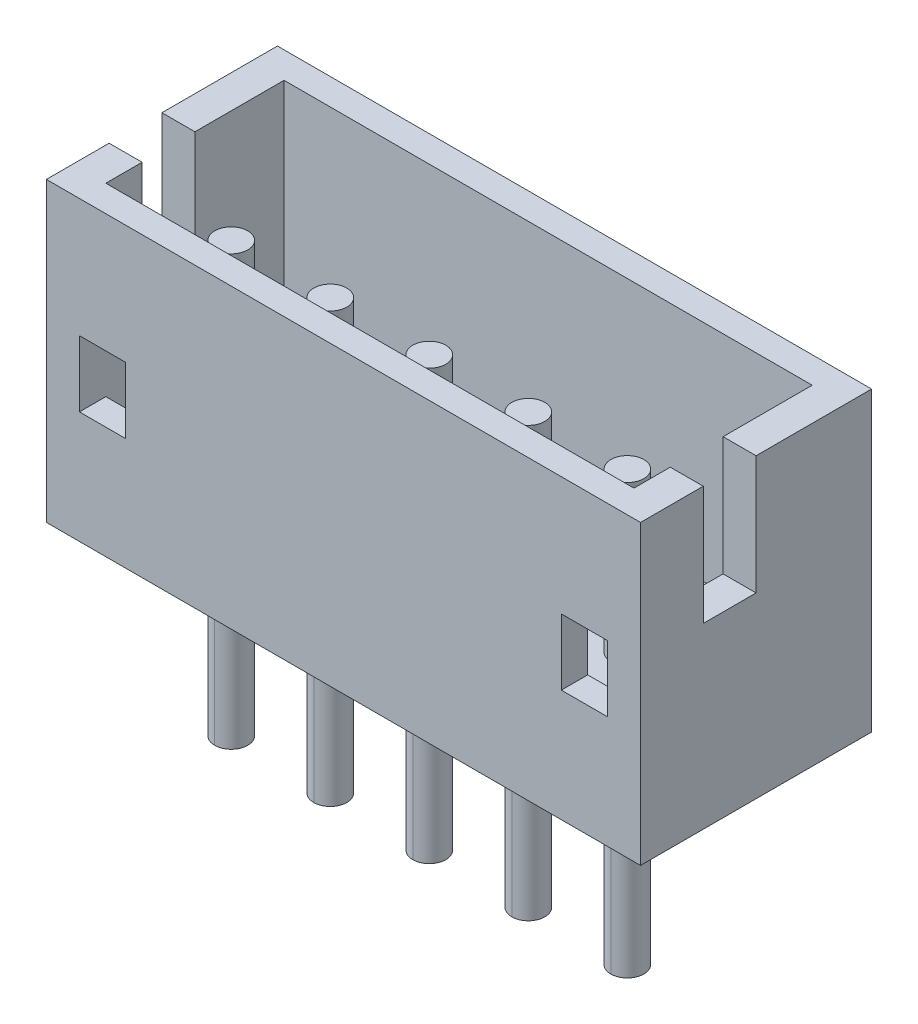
ISO-10303-21;
HEADER;
FILE_DESCRIPTION(('STEP AP214'),'2;1');
FILE_NAME('part.step','',(''),(''),'','','');
FILE_SCHEMA(('AUTOMOTIVE_DESIGN { 1 0 10303 214 1 1 1 1 }'));
ENDSEC;
DATA;
#1=APPLICATION_CONTEXT('core data for automotive mechanical design processes');
#2=APPLICATION_PROTOCOL_DEFINITION('international standard','automotive_design',2000,#1);
#3=PRODUCT_CONTEXT('',#1,'mechanical');
#4=PRODUCT('Part','Part','',(#3));
#5=PRODUCT_RELATED_PRODUCT_CATEGORY('part','',(#4));
#6=PRODUCT_DEFINITION_FORMATION('','',#4);
#7=PRODUCT_DEFINITION_CONTEXT('part definition',#1,'design');
#8=PRODUCT_DEFINITION('design','',#6,#7);
#9=PRODUCT_DEFINITION_SHAPE('','',#8);
#10=(LENGTH_UNIT() NAMED_UNIT(*) SI_UNIT(.MILLI.,.METRE.));
#11=(NAMED_UNIT(*) PLANE_ANGLE_UNIT() SI_UNIT($,.RADIAN.));
#12=(NAMED_UNIT(*) SI_UNIT($,.STERADIAN.) SOLID_ANGLE_UNIT());
#13=UNCERTAINTY_MEASURE_WITH_UNIT(LENGTH_MEASURE(1.E-05),#10,'distance_accuracy_value','');
#14=(GEOMETRIC_REPRESENTATION_CONTEXT(3) GLOBAL_UNCERTAINTY_ASSIGNED_CONTEXT((#13)) GLOBAL_UNIT_ASSIGNED_CONTEXT((#10,
#11,#12)) REPRESENTATION_CONTEXT('',''));
#15=CARTESIAN_POINT('',(0.,0.,0.));
#16=DIRECTION('',(0.,0.,1.));
#17=DIRECTION('',(1.,0.,0.));
#18=AXIS2_PLACEMENT_3D('',#15,#16,#17);
#19=CARTESIAN_POINT('',(-3.,3.8,-1.3));
#20=DIRECTION('',(0.,1.,0.));
#21=DIRECTION('',(1.,0.,0.));
#22=AXIS2_PLACEMENT_3D('',#19,#20,#21);
#23=PLANE('',#22);
#24=CARTESIAN_POINT('',(-3.,3.8,-1.3));
#25=DIRECTION('',(0.,1.,0.));
#26=DIRECTION('',(0.,0.,1.));
#27=AXIS2_PLACEMENT_3D('',#24,#25,#26);
#28=CIRCLE('',#27,0.25);
#29=CARTESIAN_POINT('',(-3.,3.8,-1.05));
#30=VERTEX_POINT('',#29);
#31=CARTESIAN_POINT('',(-3.,3.8,-1.55));
#32=VERTEX_POINT('',#31);
#33=EDGE_CURVE('E37',#30,#32,#28,.T.);
#34=ORIENTED_EDGE('',*,*,#33,.T.);
#35=CARTESIAN_POINT('',(-3.,3.8,-1.3));
#36=DIRECTION('',(0.,1.,0.));
#37=DIRECTION('',(0.,0.,1.));
#38=AXIS2_PLACEMENT_3D('',#35,#36,#37);
#39=CIRCLE('',#38,0.25);
#40=EDGE_CURVE('E706',#32,#30,#39,.T.);
#41=ORIENTED_EDGE('',*,*,#40,.T.);
#42=EDGE_LOOP('',(#34,#41));
#43=FACE_BOUND('',#42,.T.);
#44=ADVANCED_FACE('F16',(#43),#23,.T.);
#45=CARTESIAN_POINT('',(1.5,3.8,-1.3));
#46=DIRECTION('',(0.,1.,0.));
#47=DIRECTION('',(1.,0.,0.));
#48=AXIS2_PLACEMENT_3D('',#45,#46,#47);
#49=PLANE('',#48);
#50=CARTESIAN_POINT('',(1.5,3.8,-1.3));
#51=DIRECTION('',(0.,1.,0.));
#52=DIRECTION('',(0.,0.,1.));
#53=AXIS2_PLACEMENT_3D('',#50,#51,#52);
#54=CIRCLE('',#53,0.25);
#55=CARTESIAN_POINT('',(1.5,3.8,-1.05));
#56=VERTEX_POINT('',#55);
#57=CARTESIAN_POINT('',(1.5,3.8,-1.55));
#58=VERTEX_POINT('',#57);
#59=EDGE_CURVE('E10',#56,#58,#54,.T.);
#60=ORIENTED_EDGE('',*,*,#59,.T.);
#61=CARTESIAN_POINT('',(1.5,3.8,-1.3));
#62=DIRECTION('',(0.,1.,0.));
#63=DIRECTION('',(0.,0.,1.));
#64=AXIS2_PLACEMENT_3D('',#61,#62,#63);
#65=CIRCLE('',#64,0.25);
#66=EDGE_CURVE('E694',#58,#56,#65,.T.);
#67=ORIENTED_EDGE('',*,*,#66,.T.);
#68=EDGE_LOOP('',(#60,#67));
#69=FACE_BOUND('',#68,.T.);
#70=ADVANCED_FACE('F1470',(#69),#49,.T.);
#71=CARTESIAN_POINT('',(0.,3.8,-1.3));
#72=DIRECTION('',(0.,1.,0.));
#73=DIRECTION('',(1.,0.,0.));
#74=AXIS2_PLACEMENT_3D('',#71,#72,#73);
#75=PLANE('',#74);
#76=CARTESIAN_POINT('',(0.,3.8,-1.3));
#77=DIRECTION('',(0.,1.,0.));
#78=DIRECTION('',(0.,0.,1.));
#79=AXIS2_PLACEMENT_3D('',#76,#77,#78);
#80=CIRCLE('',#79,0.25);
#81=CARTESIAN_POINT('',(0.,3.8,-1.05));
#82=VERTEX_POINT('',#81);
#83=CARTESIAN_POINT('',(0.,3.8,-1.55));
#84=VERTEX_POINT('',#83);
#85=EDGE_CURVE('E533',#82,#84,#80,.T.);
#86=ORIENTED_EDGE('',*,*,#85,.T.);
#87=CARTESIAN_POINT('',(0.,3.8,-1.3));
#88=DIRECTION('',(0.,1.,0.));
#89=DIRECTION('',(0.,0.,1.));
#90=AXIS2_PLACEMENT_3D('',#87,#88,#89);
#91=CIRCLE('',#90,0.25);
#92=EDGE_CURVE('E71',#84,#82,#91,.T.);
#93=ORIENTED_EDGE('',*,*,#92,.T.);
#94=EDGE_LOOP('',(#86,#93));
#95=FACE_BOUND('',#94,.T.);
#96=ADVANCED_FACE('F1447',(#95),#75,.T.);
#97=CARTESIAN_POINT('',(3.,3.8,-1.3));
#98=DIRECTION('',(0.,1.,0.));
#99=DIRECTION('',(1.,0.,0.));
#100=AXIS2_PLACEMENT_3D('',#97,#98,#99);
#101=PLANE('',#100);
#102=CARTESIAN_POINT('',(3.,3.8,-1.3));
#103=DIRECTION('',(0.,1.,0.));
#104=DIRECTION('',(0.,0.,1.));
#105=AXIS2_PLACEMENT_3D('',#102,#103,#104);
#106=CIRCLE('',#105,0.25);
#107=CARTESIAN_POINT('',(3.,3.8,-1.05));
#108=VERTEX_POINT('',#107);
#109=CARTESIAN_POINT('',(3.,3.8,-1.55));
#110=VERTEX_POINT('',#109);
#111=EDGE_CURVE('E669',#108,#110,#106,.T.);
#112=ORIENTED_EDGE('',*,*,#111,.T.);
#113=CARTESIAN_POINT('',(3.,3.8,-1.3));
#114=DIRECTION('',(0.,1.,0.));
#115=DIRECTION('',(0.,0.,1.));
#116=AXIS2_PLACEMENT_3D('',#113,#114,#115);
#117=CIRCLE('',#116,0.25);
#118=EDGE_CURVE('E674',#110,#108,#117,.T.);
#119=ORIENTED_EDGE('',*,*,#118,.T.);
#120=EDGE_LOOP('',(#112,#119));
#121=FACE_BOUND('',#120,.T.);
#122=ADVANCED_FACE('F973',(#121),#101,.T.);
#123=CARTESIAN_POINT('',(-1.5,3.8,-1.3));
#124=DIRECTION('',(0.,1.,0.));
#125=DIRECTION('',(1.,0.,0.));
#126=AXIS2_PLACEMENT_3D('',#123,#124,#125);
#127=PLANE('',#126);
#128=CARTESIAN_POINT('',(-1.5,3.8,-1.3));
#129=DIRECTION('',(0.,1.,0.));
#130=DIRECTION('',(0.,0.,1.));
#131=AXIS2_PLACEMENT_3D('',#128,#129,#130);
#132=CIRCLE('',#131,0.25);
#133=CARTESIAN_POINT('',(-1.5,3.8,-1.05));
#134=VERTEX_POINT('',#133);
#135=CARTESIAN_POINT('',(-1.5,3.8,-1.55));
#136=VERTEX_POINT('',#135);
#137=EDGE_CURVE('E550',#134,#136,#132,.T.);
#138=ORIENTED_EDGE('',*,*,#137,.T.);
#139=CARTESIAN_POINT('',(-1.5,3.8,-1.3));
#140=DIRECTION('',(0.,1.,0.));
#141=DIRECTION('',(0.,0.,1.));
#142=AXIS2_PLACEMENT_3D('',#139,#140,#141);
#143=CIRCLE('',#142,0.25);
#144=EDGE_CURVE('E24',#136,#134,#143,.T.);
#145=ORIENTED_EDGE('',*,*,#144,.T.);
#146=EDGE_LOOP('',(#138,#145));
#147=FACE_BOUND('',#146,.T.);
#148=ADVANCED_FACE('F714',(#147),#127,.T.);
#149=CARTESIAN_POINT('',(1.5,-2.7,-1.3));
#150=DIRECTION('',(0.,1.,0.));
#151=DIRECTION('',(0.,0.,1.));
#152=AXIS2_PLACEMENT_3D('',#149,#150,#151);
#153=CYLINDRICAL_SURFACE('',#152,0.25);
#154=CARTESIAN_POINT('',(1.5,1.4,-1.3));
#155=DIRECTION('',(0.,1.,0.));
#156=DIRECTION('',(0.,0.,1.));
#157=AXIS2_PLACEMENT_3D('',#154,#155,#156);
#158=CIRCLE('',#157,0.25);
#159=CARTESIAN_POINT('',(1.5,1.4,-1.05));
#160=VERTEX_POINT('',#159);
#161=CARTESIAN_POINT('',(1.5,1.4,-1.55));
#162=VERTEX_POINT('',#161);
#163=EDGE_CURVE('E663',#160,#162,#158,.T.);
#164=ORIENTED_EDGE('',*,*,#163,.T.);
#165=DIRECTION('',(0.,1.,0.));
#166=VECTOR('',#165,1.);
#167=CARTESIAN_POINT('',(1.5,-2.7,-1.55));
#168=LINE('',#167,#166);
#169=EDGE_CURVE('E532',#162,#58,#168,.T.);
#170=ORIENTED_EDGE('',*,*,#169,.T.);
#171=ORIENTED_EDGE('',*,*,#59,.F.);
#172=DIRECTION('',(0.,1.,0.));
#173=VECTOR('',#172,1.);
#174=CARTESIAN_POINT('',(1.5,-2.7,-1.05));
#175=LINE('',#174,#173);
#176=EDGE_CURVE('E690',#160,#56,#175,.T.);
#177=ORIENTED_EDGE('',*,*,#176,.F.);
#178=EDGE_LOOP('',(#164,#170,#171,#177));
#179=FACE_BOUND('',#178,.T.);
#180=ADVANCED_FACE('F1346',(#179),#153,.T.);
#181=CARTESIAN_POINT('',(-1.5,-2.7,-1.3));
#182=DIRECTION('',(0.,1.,0.));
#183=DIRECTION('',(0.,0.,1.));
#184=AXIS2_PLACEMENT_3D('',#181,#182,#183);
#185=CYLINDRICAL_SURFACE('',#184,0.25);
#186=DIRECTION('',(0.,1.,0.));
#187=VECTOR('',#186,1.);
#188=CARTESIAN_POINT('',(-1.5,-2.7,-1.55));
#189=LINE('',#188,#187);
#190=CARTESIAN_POINT('',(-1.5,1.4,-1.55));
#191=VERTEX_POINT('',#190);
#192=EDGE_CURVE('E546',#191,#136,#189,.T.);
#193=ORIENTED_EDGE('',*,*,#192,.F.);
#194=CARTESIAN_POINT('',(-1.5,1.4,-1.3));
#195=DIRECTION('',(0.,1.,0.));
#196=DIRECTION('',(0.,0.,1.));
#197=AXIS2_PLACEMENT_3D('',#194,#195,#196);
#198=CIRCLE('',#197,0.25);
#199=CARTESIAN_POINT('',(-1.5,1.4,-1.05));
#200=VERTEX_POINT('',#199);
#201=EDGE_CURVE('E651',#191,#200,#198,.T.);
#202=ORIENTED_EDGE('',*,*,#201,.T.);
#203=DIRECTION('',(0.,1.,0.));
#204=VECTOR('',#203,1.);
#205=CARTESIAN_POINT('',(-1.5,-2.7,-1.05));
#206=LINE('',#205,#204);
#207=EDGE_CURVE('E679',#200,#134,#206,.T.);
#208=ORIENTED_EDGE('',*,*,#207,.T.);
#209=ORIENTED_EDGE('',*,*,#144,.F.);
#210=EDGE_LOOP('',(#193,#202,#208,#209));
#211=FACE_BOUND('',#210,.T.);
#212=ADVANCED_FACE('F716',(#211),#185,.T.);
#213=CARTESIAN_POINT('',(-3.,-2.7,-1.3));
#214=DIRECTION('',(0.,1.,0.));
#215=DIRECTION('',(0.,0.,1.));
#216=AXIS2_PLACEMENT_3D('',#213,#214,#215);
#217=CYLINDRICAL_SURFACE('',#216,0.25);
#218=CARTESIAN_POINT('',(-3.,1.4,-1.3));
#219=DIRECTION('',(0.,1.,0.));
#220=DIRECTION('',(0.,0.,1.));
#221=AXIS2_PLACEMENT_3D('',#218,#219,#220);
#222=CIRCLE('',#221,0.25);
#223=CARTESIAN_POINT('',(-3.,1.4,-1.05));
#224=VERTEX_POINT('',#223);
#225=CARTESIAN_POINT('',(-3.,1.4,-1.55));
#226=VERTEX_POINT('',#225);
#227=EDGE_CURVE('E511',#224,#226,#222,.T.);
#228=ORIENTED_EDGE('',*,*,#227,.T.);
#229=DIRECTION('',(0.,1.,0.));
#230=VECTOR('',#229,1.);
#231=CARTESIAN_POINT('',(-3.,-2.7,-1.55));
#232=LINE('',#231,#230);
#233=EDGE_CURVE('E699',#226,#32,#232,.T.);
#234=ORIENTED_EDGE('',*,*,#233,.T.);
#235=ORIENTED_EDGE('',*,*,#33,.F.);
#236=DIRECTION('',(0.,1.,0.));
#237=VECTOR('',#236,1.);
#238=CARTESIAN_POINT('',(-3.,-2.7,-1.05));
#239=LINE('',#238,#237);
#240=EDGE_CURVE('E702',#224,#30,#239,.T.);
#241=ORIENTED_EDGE('',*,*,#240,.F.);
#242=EDGE_LOOP('',(#228,#234,#235,#241));
#243=FACE_BOUND('',#242,.T.);
#244=ADVANCED_FACE('F1657',(#243),#217,.T.);
#245=CARTESIAN_POINT('',(-3.,-2.7,-1.3));
#246=DIRECTION('',(0.,1.,0.));
#247=DIRECTION('',(0.,0.,1.));
#248=AXIS2_PLACEMENT_3D('',#245,#246,#247);
#249=CYLINDRICAL_SURFACE('',#248,0.25);
#250=ORIENTED_EDGE('',*,*,#233,.F.);
#251=CARTESIAN_POINT('',(-3.,1.4,-1.3));
#252=DIRECTION('',(0.,1.,0.));
#253=DIRECTION('',(0.,0.,1.));
#254=AXIS2_PLACEMENT_3D('',#251,#252,#253);
#255=CIRCLE('',#254,0.25);
#256=EDGE_CURVE('E470',#226,#224,#255,.T.);
#257=ORIENTED_EDGE('',*,*,#256,.T.);
#258=ORIENTED_EDGE('',*,*,#240,.T.);
#259=ORIENTED_EDGE('',*,*,#40,.F.);
#260=EDGE_LOOP('',(#250,#257,#258,#259));
#261=FACE_BOUND('',#260,.T.);
#262=ADVANCED_FACE('F1651',(#261),#249,.T.);
#263=CARTESIAN_POINT('',(0.,-2.7,-1.3));
#264=DIRECTION('',(0.,1.,0.));
#265=DIRECTION('',(0.,0.,1.));
#266=AXIS2_PLACEMENT_3D('',#263,#264,#265);
#267=CYLINDRICAL_SURFACE('',#266,0.25);
#268=DIRECTION('',(0.,1.,0.));
#269=VECTOR('',#268,1.);
#270=CARTESIAN_POINT('',(0.,-2.7,-1.55));
#271=LINE('',#270,#269);
#272=CARTESIAN_POINT('',(0.,1.4,-1.55));
#273=VERTEX_POINT('',#272);
#274=EDGE_CURVE('E673',#273,#84,#271,.T.);
#275=ORIENTED_EDGE('',*,*,#274,.F.);
#276=CARTESIAN_POINT('',(0.,1.4,-1.3));
#277=DIRECTION('',(0.,1.,0.));
#278=DIRECTION('',(0.,0.,1.));
#279=AXIS2_PLACEMENT_3D('',#276,#277,#278);
#280=CIRCLE('',#279,0.25);
#281=CARTESIAN_POINT('',(0.,1.4,-1.05));
#282=VERTEX_POINT('',#281);
#283=EDGE_CURVE('E659',#273,#282,#280,.T.);
#284=ORIENTED_EDGE('',*,*,#283,.T.);
#285=DIRECTION('',(0.,1.,0.));
#286=VECTOR('',#285,1.);
#287=CARTESIAN_POINT('',(0.,-2.7,-1.05));
#288=LINE('',#287,#286);
#289=EDGE_CURVE('E529',#282,#82,#288,.T.);
#290=ORIENTED_EDGE('',*,*,#289,.T.);
#291=ORIENTED_EDGE('',*,*,#92,.F.);
#292=EDGE_LOOP('',(#275,#284,#290,#291));
#293=FACE_BOUND('',#292,.T.);
#294=ADVANCED_FACE('F1656',(#293),#267,.T.);
#295=CARTESIAN_POINT('',(1.5,-2.7,-1.3));
#296=DIRECTION('',(0.,1.,0.));
#297=DIRECTION('',(0.,0.,1.));
#298=AXIS2_PLACEMENT_3D('',#295,#296,#297);
#299=CYLINDRICAL_SURFACE('',#298,0.25);
#300=ORIENTED_EDGE('',*,*,#169,.F.);
#301=CARTESIAN_POINT('',(1.5,1.4,-1.3));
#302=DIRECTION('',(0.,1.,0.));
#303=DIRECTION('',(0.,0.,1.));
#304=AXIS2_PLACEMENT_3D('',#301,#302,#303);
#305=CIRCLE('',#304,0.25);
#306=EDGE_CURVE('E664',#162,#160,#305,.T.);
#307=ORIENTED_EDGE('',*,*,#306,.T.);
#308=ORIENTED_EDGE('',*,*,#176,.T.);
#309=ORIENTED_EDGE('',*,*,#66,.F.);
#310=EDGE_LOOP('',(#300,#307,#308,#309));
#311=FACE_BOUND('',#310,.T.);
#312=ADVANCED_FACE('F1570',(#311),#299,.T.);
#313=CARTESIAN_POINT('',(0.,-2.7,-1.3));
#314=DIRECTION('',(0.,1.,0.));
#315=DIRECTION('',(0.,0.,1.));
#316=AXIS2_PLACEMENT_3D('',#313,#314,#315);
#317=CYLINDRICAL_SURFACE('',#316,0.25);
#318=CARTESIAN_POINT('',(0.,1.4,-1.3));
#319=DIRECTION('',(0.,1.,0.));
#320=DIRECTION('',(0.,0.,1.));
#321=AXIS2_PLACEMENT_3D('',#318,#319,#320);
#322=CIRCLE('',#321,0.25);
#323=EDGE_CURVE('E655',#282,#273,#322,.T.);
#324=ORIENTED_EDGE('',*,*,#323,.T.);
#325=ORIENTED_EDGE('',*,*,#274,.T.);
#326=ORIENTED_EDGE('',*,*,#85,.F.);
#327=ORIENTED_EDGE('',*,*,#289,.F.);
#328=EDGE_LOOP('',(#324,#325,#326,#327));
#329=FACE_BOUND('',#328,.T.);
#330=ADVANCED_FACE('F1566',(#329),#317,.T.);
#331=CARTESIAN_POINT('',(3.,-2.7,-1.3));
#332=DIRECTION('',(0.,1.,0.));
#333=DIRECTION('',(0.,0.,1.));
#334=AXIS2_PLACEMENT_3D('',#331,#332,#333);
#335=CYLINDRICAL_SURFACE('',#334,0.25);
#336=CARTESIAN_POINT('',(3.,1.4,-1.3));
#337=DIRECTION('',(0.,1.,0.));
#338=DIRECTION('',(0.,0.,1.));
#339=AXIS2_PLACEMENT_3D('',#336,#337,#338);
#340=CIRCLE('',#339,0.25);
#341=CARTESIAN_POINT('',(3.,1.4,-1.05));
#342=VERTEX_POINT('',#341);
#343=CARTESIAN_POINT('',(3.,1.4,-1.55));
#344=VERTEX_POINT('',#343);
#345=EDGE_CURVE('E668',#342,#344,#340,.T.);
#346=ORIENTED_EDGE('',*,*,#345,.T.);
#347=DIRECTION('',(0.,1.,0.));
#348=VECTOR('',#347,1.);
#349=CARTESIAN_POINT('',(3.,-2.7,-1.55));
#350=LINE('',#349,#348);
#351=EDGE_CURVE('E381',#344,#110,#350,.T.);
#352=ORIENTED_EDGE('',*,*,#351,.T.);
#353=ORIENTED_EDGE('',*,*,#111,.F.);
#354=DIRECTION('',(0.,1.,0.));
#355=VECTOR('',#354,1.);
#356=CARTESIAN_POINT('',(3.,-2.7,-1.05));
#357=LINE('',#356,#355);
#358=EDGE_CURVE('E686',#342,#108,#357,.T.);
#359=ORIENTED_EDGE('',*,*,#358,.F.);
#360=EDGE_LOOP('',(#346,#352,#353,#359));
#361=FACE_BOUND('',#360,.T.);
#362=ADVANCED_FACE('F977',(#361),#335,.T.);
#363=CARTESIAN_POINT('',(3.,-2.7,-1.3));
#364=DIRECTION('',(0.,1.,0.));
#365=DIRECTION('',(0.,0.,1.));
#366=AXIS2_PLACEMENT_3D('',#363,#364,#365);
#367=CYLINDRICAL_SURFACE('',#366,0.25);
#368=ORIENTED_EDGE('',*,*,#351,.F.);
#369=CARTESIAN_POINT('',(3.,1.4,-1.3));
#370=DIRECTION('',(0.,1.,0.));
#371=DIRECTION('',(0.,0.,1.));
#372=AXIS2_PLACEMENT_3D('',#369,#370,#371);
#373=CIRCLE('',#372,0.25);
#374=EDGE_CURVE('E617',#344,#342,#373,.T.);
#375=ORIENTED_EDGE('',*,*,#374,.T.);
#376=ORIENTED_EDGE('',*,*,#358,.T.);
#377=ORIENTED_EDGE('',*,*,#118,.F.);
#378=EDGE_LOOP('',(#368,#375,#376,#377));
#379=FACE_BOUND('',#378,.T.);
#380=ADVANCED_FACE('F974',(#379),#367,.T.);
#381=CARTESIAN_POINT('',(-1.5,-2.7,-1.3));
#382=DIRECTION('',(0.,1.,0.));
#383=DIRECTION('',(0.,0.,1.));
#384=AXIS2_PLACEMENT_3D('',#381,#382,#383);
#385=CYLINDRICAL_SURFACE('',#384,0.25);
#386=CARTESIAN_POINT('',(-1.5,1.4,-1.3));
#387=DIRECTION('',(0.,1.,0.));
#388=DIRECTION('',(0.,0.,1.));
#389=AXIS2_PLACEMENT_3D('',#386,#387,#388);
#390=CIRCLE('',#389,0.25);
#391=EDGE_CURVE('E647',#200,#191,#390,.T.);
#392=ORIENTED_EDGE('',*,*,#391,.T.);
#393=ORIENTED_EDGE('',*,*,#192,.T.);
#394=ORIENTED_EDGE('',*,*,#137,.F.);
#395=ORIENTED_EDGE('',*,*,#207,.F.);
#396=EDGE_LOOP('',(#392,#393,#394,#395));
#397=FACE_BOUND('',#396,.T.);
#398=ADVANCED_FACE('F720',(#397),#385,.T.);
#399=CARTESIAN_POINT('',(-1.5,-2.7,-1.3));
#400=DIRECTION('',(0.,1.,0.));
#401=DIRECTION('',(1.,0.,0.));
#402=AXIS2_PLACEMENT_3D('',#399,#400,#401);
#403=PLANE('',#402);
#404=CARTESIAN_POINT('',(-1.5,-2.7,-1.3));
#405=DIRECTION('',(0.,1.,0.));
#406=DIRECTION('',(0.,0.,1.));
#407=AXIS2_PLACEMENT_3D('',#404,#405,#406);
#408=CIRCLE('',#407,0.25);
#409=CARTESIAN_POINT('',(-1.5,-2.7,-1.05));
#410=VERTEX_POINT('',#409);
#411=CARTESIAN_POINT('',(-1.5,-2.7,-1.55));
#412=VERTEX_POINT('',#411);
#413=EDGE_CURVE('E838',#410,#412,#408,.T.);
#414=ORIENTED_EDGE('',*,*,#413,.F.);
#415=CARTESIAN_POINT('',(-1.5,-2.7,-1.3));
#416=DIRECTION('',(0.,1.,0.));
#417=DIRECTION('',(0.,0.,1.));
#418=AXIS2_PLACEMENT_3D('',#415,#416,#417);
#419=CIRCLE('',#418,0.25);
#420=EDGE_CURVE('E568',#412,#410,#419,.T.);
#421=ORIENTED_EDGE('',*,*,#420,.F.);
#422=EDGE_LOOP('',(#414,#421));
#423=FACE_BOUND('',#422,.T.);
#424=ADVANCED_FACE('F1621',(#423),#403,.F.);
#425=CARTESIAN_POINT('',(-3.,-2.7,-1.3));
#426=DIRECTION('',(0.,1.,0.));
#427=DIRECTION('',(1.,0.,0.));
#428=AXIS2_PLACEMENT_3D('',#425,#426,#427);
#429=PLANE('',#428);
#430=CARTESIAN_POINT('',(-3.,-2.7,-1.3));
#431=DIRECTION('',(0.,1.,0.));
#432=DIRECTION('',(0.,0.,1.));
#433=AXIS2_PLACEMENT_3D('',#430,#431,#432);
#434=CIRCLE('',#433,0.25);
#435=CARTESIAN_POINT('',(-3.,-2.7,-1.05));
#436=VERTEX_POINT('',#435);
#437=CARTESIAN_POINT('',(-3.,-2.7,-1.55));
#438=VERTEX_POINT('',#437);
#439=EDGE_CURVE('E472',#436,#438,#434,.T.);
#440=ORIENTED_EDGE('',*,*,#439,.F.);
#441=CARTESIAN_POINT('',(-3.,-2.7,-1.3));
#442=DIRECTION('',(0.,1.,0.));
#443=DIRECTION('',(0.,0.,1.));
#444=AXIS2_PLACEMENT_3D('',#441,#442,#443);
#445=CIRCLE('',#444,0.25);
#446=EDGE_CURVE('E597',#438,#436,#445,.T.);
#447=ORIENTED_EDGE('',*,*,#446,.F.);
#448=EDGE_LOOP('',(#440,#447));
#449=FACE_BOUND('',#448,.T.);
#450=ADVANCED_FACE('F1373',(#449),#429,.F.);
#451=CARTESIAN_POINT('',(3.,-2.7,-1.3));
#452=DIRECTION('',(0.,1.,0.));
#453=DIRECTION('',(1.,0.,0.));
#454=AXIS2_PLACEMENT_3D('',#451,#452,#453);
#455=PLANE('',#454);
#456=CARTESIAN_POINT('',(3.,-2.7,-1.3));
#457=DIRECTION('',(0.,1.,0.));
#458=DIRECTION('',(0.,0.,1.));
#459=AXIS2_PLACEMENT_3D('',#456,#457,#458);
#460=CIRCLE('',#459,0.25);
#461=CARTESIAN_POINT('',(3.,-2.7,-1.05));
#462=VERTEX_POINT('',#461);
#463=CARTESIAN_POINT('',(3.,-2.7,-1.55));
#464=VERTEX_POINT('',#463);
#465=EDGE_CURVE('E624',#462,#464,#460,.T.);
#466=ORIENTED_EDGE('',*,*,#465,.F.);
#467=CARTESIAN_POINT('',(3.,-2.7,-1.3));
#468=DIRECTION('',(0.,1.,0.));
#469=DIRECTION('',(0.,0.,1.));
#470=AXIS2_PLACEMENT_3D('',#467,#468,#469);
#471=CIRCLE('',#470,0.25);
#472=EDGE_CURVE('E518',#464,#462,#471,.T.);
#473=ORIENTED_EDGE('',*,*,#472,.F.);
#474=EDGE_LOOP('',(#466,#473));
#475=FACE_BOUND('',#474,.T.);
#476=ADVANCED_FACE('F1368',(#475),#455,.F.);
#477=CARTESIAN_POINT('',(0.,-2.7,-1.3));
#478=DIRECTION('',(0.,1.,0.));
#479=DIRECTION('',(1.,0.,0.));
#480=AXIS2_PLACEMENT_3D('',#477,#478,#479);
#481=PLANE('',#480);
#482=CARTESIAN_POINT('',(0.,-2.7,-1.3));
#483=DIRECTION('',(0.,1.,0.));
#484=DIRECTION('',(0.,0.,1.));
#485=AXIS2_PLACEMENT_3D('',#482,#483,#484);
#486=CIRCLE('',#485,0.25);
#487=CARTESIAN_POINT('',(0.,-2.7,-1.05));
#488=VERTEX_POINT('',#487);
#489=CARTESIAN_POINT('',(0.,-2.7,-1.55));
#490=VERTEX_POINT('',#489);
#491=EDGE_CURVE('E474',#488,#490,#486,.T.);
#492=ORIENTED_EDGE('',*,*,#491,.F.);
#493=CARTESIAN_POINT('',(0.,-2.7,-1.3));
#494=DIRECTION('',(0.,1.,0.));
#495=DIRECTION('',(0.,0.,1.));
#496=AXIS2_PLACEMENT_3D('',#493,#494,#495);
#497=CIRCLE('',#496,0.25);
#498=EDGE_CURVE('E480',#490,#488,#497,.T.);
#499=ORIENTED_EDGE('',*,*,#498,.F.);
#500=EDGE_LOOP('',(#492,#499));
#501=FACE_BOUND('',#500,.T.);
#502=ADVANCED_FACE('F1372',(#501),#481,.F.);
#503=CARTESIAN_POINT('',(1.5,-2.7,-1.3));
#504=DIRECTION('',(0.,1.,0.));
#505=DIRECTION('',(1.,0.,0.));
#506=AXIS2_PLACEMENT_3D('',#503,#504,#505);
#507=PLANE('',#506);
#508=CARTESIAN_POINT('',(1.5,-2.7,-1.3));
#509=DIRECTION('',(0.,1.,0.));
#510=DIRECTION('',(0.,0.,1.));
#511=AXIS2_PLACEMENT_3D('',#508,#509,#510);
#512=CIRCLE('',#511,0.25);
#513=CARTESIAN_POINT('',(1.5,-2.7,-1.05));
#514=VERTEX_POINT('',#513);
#515=CARTESIAN_POINT('',(1.5,-2.7,-1.55));
#516=VERTEX_POINT('',#515);
#517=EDGE_CURVE('E583',#514,#516,#512,.T.);
#518=ORIENTED_EDGE('',*,*,#517,.F.);
#519=CARTESIAN_POINT('',(1.5,-2.7,-1.3));
#520=DIRECTION('',(0.,1.,0.));
#521=DIRECTION('',(0.,0.,1.));
#522=AXIS2_PLACEMENT_3D('',#519,#520,#521);
#523=CIRCLE('',#522,0.25);
#524=EDGE_CURVE('E519',#516,#514,#523,.T.);
#525=ORIENTED_EDGE('',*,*,#524,.F.);
#526=EDGE_LOOP('',(#518,#525));
#527=FACE_BOUND('',#526,.T.);
#528=ADVANCED_FACE('F1044',(#527),#507,.F.);
#529=CARTESIAN_POINT('',(-4.5,2.7,-0.95));
#530=DIRECTION('',(0.,-1.,0.));
#531=DIRECTION('',(0.,0.,-1.));
#532=AXIS2_PLACEMENT_3D('',#529,#530,#531);
#533=PLANE('',#532);
#534=DIRECTION('',(1.,0.,0.));
#535=VECTOR('',#534,1.);
#536=CARTESIAN_POINT('',(-4.5,2.7,-1.75));
#537=LINE('',#536,#535);
#538=CARTESIAN_POINT('',(-4.5,2.7,-1.75));
#539=VERTEX_POINT('',#538);
#540=CARTESIAN_POINT('',(-4.,2.7,-1.75));
#541=VERTEX_POINT('',#540);
#542=EDGE_CURVE('E614',#539,#541,#537,.T.);
#543=ORIENTED_EDGE('',*,*,#542,.F.);
#544=DIRECTION('',(0.,0.,-1.));
#545=VECTOR('',#544,1.);
#546=CARTESIAN_POINT('',(-4.5,2.7,-0.95));
#547=LINE('',#546,#545);
#548=CARTESIAN_POINT('',(-4.5,2.7,-0.95));
#549=VERTEX_POINT('',#548);
#550=EDGE_CURVE('E485',#549,#539,#547,.T.);
#551=ORIENTED_EDGE('',*,*,#550,.F.);
#552=DIRECTION('',(1.,0.,0.));
#553=VECTOR('',#552,1.);
#554=CARTESIAN_POINT('',(-4.5,2.7,-0.95));
#555=LINE('',#554,#553);
#556=CARTESIAN_POINT('',(-4.,2.7,-0.95));
#557=VERTEX_POINT('',#556);
#558=EDGE_CURVE('E551',#549,#557,#555,.T.);
#559=ORIENTED_EDGE('',*,*,#558,.T.);
#560=DIRECTION('',(0.,0.,1.));
#561=VECTOR('',#560,1.);
#562=CARTESIAN_POINT('',(-4.,2.7,-3.1));
#563=LINE('',#562,#561);
#564=EDGE_CURVE('E524',#541,#557,#563,.T.);
#565=ORIENTED_EDGE('',*,*,#564,.F.);
#566=EDGE_LOOP('',(#543,#551,#559,#565));
#567=FACE_BOUND('',#566,.T.);
#568=ADVANCED_FACE('F1038',(#567),#533,.F.);
#569=CARTESIAN_POINT('',(-4.5,4.5,-0.95));
#570=DIRECTION('',(0.,0.,1.));
#571=DIRECTION('',(0.,-1.,0.));
#572=AXIS2_PLACEMENT_3D('',#569,#570,#571);
#573=PLANE('',#572);
#574=ORIENTED_EDGE('',*,*,#558,.F.);
#575=DIRECTION('',(0.,-1.,0.));
#576=VECTOR('',#575,1.);
#577=CARTESIAN_POINT('',(-4.5,4.5,-0.95));
#578=LINE('',#577,#576);
#579=CARTESIAN_POINT('',(-4.5,4.5,-0.95));
#580=VERTEX_POINT('',#579);
#581=EDGE_CURVE('E490',#580,#549,#578,.T.);
#582=ORIENTED_EDGE('',*,*,#581,.F.);
#583=DIRECTION('',(1.,0.,0.));
#584=VECTOR('',#583,1.);
#585=CARTESIAN_POINT('',(-4.5,4.5,-0.95));
#586=LINE('',#585,#584);
#587=CARTESIAN_POINT('',(-4.,4.5,-0.95));
#588=VERTEX_POINT('',#587);
#589=EDGE_CURVE('E520',#580,#588,#586,.T.);
#590=ORIENTED_EDGE('',*,*,#589,.T.);
#591=DIRECTION('',(0.,1.,0.));
#592=VECTOR('',#591,1.);
#593=CARTESIAN_POINT('',(-4.,1.4,-0.95));
#594=LINE('',#593,#592);
#595=EDGE_CURVE('E561',#557,#588,#594,.T.);
#596=ORIENTED_EDGE('',*,*,#595,.F.);
#597=EDGE_LOOP('',(#574,#582,#590,#596));
#598=FACE_BOUND('',#597,.T.);
#599=ADVANCED_FACE('F1043',(#598),#573,.F.);
#600=CARTESIAN_POINT('',(-4.5,4.5,-1.75));
#601=DIRECTION('',(0.,0.,-1.));
#602=DIRECTION('',(-1.,0.,0.));
#603=AXIS2_PLACEMENT_3D('',#600,#601,#602);
#604=PLANE('',#603);
#605=DIRECTION('',(1.,0.,0.));
#606=VECTOR('',#605,1.);
#607=CARTESIAN_POINT('',(-4.5,4.5,-1.75));
#608=LINE('',#607,#606);
#609=CARTESIAN_POINT('',(-4.5,4.5,-1.75));
#610=VERTEX_POINT('',#609);
#611=CARTESIAN_POINT('',(-4.,4.5,-1.75));
#612=VERTEX_POINT('',#611);
#613=EDGE_CURVE('E443',#610,#612,#608,.T.);
#614=ORIENTED_EDGE('',*,*,#613,.F.);
#615=DIRECTION('',(0.,1.,0.));
#616=VECTOR('',#615,1.);
#617=CARTESIAN_POINT('',(-4.5,4.5,-1.75));
#618=LINE('',#617,#616);
#619=EDGE_CURVE('E489',#539,#610,#618,.T.);
#620=ORIENTED_EDGE('',*,*,#619,.F.);
#621=ORIENTED_EDGE('',*,*,#542,.T.);
#622=DIRECTION('',(0.,-1.,0.));
#623=VECTOR('',#622,1.);
#624=CARTESIAN_POINT('',(-4.,1.4,-1.75));
#625=LINE('',#624,#623);
#626=EDGE_CURVE('E593',#612,#541,#625,.T.);
#627=ORIENTED_EDGE('',*,*,#626,.F.);
#628=EDGE_LOOP('',(#614,#620,#621,#627));
#629=FACE_BOUND('',#628,.T.);
#630=ADVANCED_FACE('F1059',(#629),#604,.F.);
#631=CARTESIAN_POINT('',(-4.,1.4,-3.1));
#632=DIRECTION('',(0.,0.,-1.));
#633=DIRECTION('',(-1.,0.,0.));
#634=AXIS2_PLACEMENT_3D('',#631,#632,#633);
#635=PLANE('',#634);
#636=DIRECTION('',(-1.,0.,0.));
#637=VECTOR('',#636,1.);
#638=CARTESIAN_POINT('',(-4.,4.5,-3.1));
#639=LINE('',#638,#637);
#640=CARTESIAN_POINT('',(4.,4.5,-3.1));
#641=VERTEX_POINT('',#640);
#642=CARTESIAN_POINT('',(-4.,4.5,-3.1));
#643=VERTEX_POINT('',#642);
#644=EDGE_CURVE('E429',#641,#643,#639,.T.);
#645=ORIENTED_EDGE('',*,*,#644,.T.);
#646=DIRECTION('',(0.,1.,0.));
#647=VECTOR('',#646,1.);
#648=CARTESIAN_POINT('',(-4.,1.4,-3.1));
#649=LINE('',#648,#647);
#650=CARTESIAN_POINT('',(-4.,1.1,-3.1));
#651=VERTEX_POINT('',#650);
#652=EDGE_CURVE('E556',#651,#643,#649,.T.);
#653=ORIENTED_EDGE('',*,*,#652,.F.);
#654=DIRECTION('',(-1.,0.,0.));
#655=VECTOR('',#654,1.);
#656=CARTESIAN_POINT('',(4.,1.1,-3.1));
#657=LINE('',#656,#655);
#658=CARTESIAN_POINT('',(4.,1.1,-3.1));
#659=VERTEX_POINT('',#658);
#660=EDGE_CURVE('E448',#659,#651,#657,.T.);
#661=ORIENTED_EDGE('',*,*,#660,.F.);
#662=DIRECTION('',(0.,1.,0.));
#663=VECTOR('',#662,1.);
#664=CARTESIAN_POINT('',(4.,1.4,-3.1));
#665=LINE('',#664,#663);
#666=EDGE_CURVE('E446',#659,#641,#665,.T.);
#667=ORIENTED_EDGE('',*,*,#666,.T.);
#668=EDGE_LOOP('',(#645,#653,#661,#667));
#669=FACE_BOUND('',#668,.T.);
#670=ADVANCED_FACE('F447',(#669),#635,.F.);
#671=CARTESIAN_POINT('',(-4.,1.4,-3.1));
#672=DIRECTION('',(0.,1.,0.));
#673=DIRECTION('',(1.,0.,0.));
#674=AXIS2_PLACEMENT_3D('',#671,#672,#673);
#675=PLANE('',#674);
#676=ORIENTED_EDGE('',*,*,#345,.F.);
#677=ORIENTED_EDGE('',*,*,#374,.F.);
#678=EDGE_LOOP('',(#676,#677));
#679=FACE_BOUND('',#678,.T.);
#680=ORIENTED_EDGE('',*,*,#163,.F.);
#681=ORIENTED_EDGE('',*,*,#306,.F.);
#682=EDGE_LOOP('',(#680,#681));
#683=FACE_BOUND('',#682,.T.);
#684=ORIENTED_EDGE('',*,*,#323,.F.);
#685=ORIENTED_EDGE('',*,*,#283,.F.);
#686=EDGE_LOOP('',(#684,#685));
#687=FACE_BOUND('',#686,.T.);
#688=ORIENTED_EDGE('',*,*,#391,.F.);
#689=ORIENTED_EDGE('',*,*,#201,.F.);
#690=EDGE_LOOP('',(#688,#689));
#691=FACE_BOUND('',#690,.T.);
#692=ORIENTED_EDGE('',*,*,#227,.F.);
#693=ORIENTED_EDGE('',*,*,#256,.F.);
#694=EDGE_LOOP('',(#692,#693));
#695=FACE_BOUND('',#694,.T.);
#696=DIRECTION('',(0.,0.,-1.));
#697=VECTOR('',#696,1.);
#698=CARTESIAN_POINT('',(4.,1.4,-3.1));
#699=LINE('',#698,#697);
#700=CARTESIAN_POINT('',(4.,1.4,-0.4));
#701=VERTEX_POINT('',#700);
#702=CARTESIAN_POINT('',(4.,1.4,-1.75));
#703=VERTEX_POINT('',#702);
#704=EDGE_CURVE('E494',#701,#703,#699,.T.);
#705=ORIENTED_EDGE('',*,*,#704,.T.);
#706=DIRECTION('',(-1.,0.,0.));
#707=VECTOR('',#706,1.);
#708=CARTESIAN_POINT('',(4.,1.4,-1.75));
#709=LINE('',#708,#707);
#710=CARTESIAN_POINT('',(-4.,1.4,-1.75));
#711=VERTEX_POINT('',#710);
#712=EDGE_CURVE('E641',#703,#711,#709,.T.);
#713=ORIENTED_EDGE('',*,*,#712,.T.);
#714=DIRECTION('',(0.,0.,1.));
#715=VECTOR('',#714,1.);
#716=CARTESIAN_POINT('',(-4.,1.4,-3.1));
#717=LINE('',#716,#715);
#718=CARTESIAN_POINT('',(-4.,1.4,-0.4));
#719=VERTEX_POINT('',#718);
#720=EDGE_CURVE('E578',#711,#719,#717,.T.);
#721=ORIENTED_EDGE('',*,*,#720,.T.);
#722=DIRECTION('',(1.,0.,0.));
#723=VECTOR('',#722,1.);
#724=CARTESIAN_POINT('',(-4.,1.4,-0.4));
#725=LINE('',#724,#723);
#726=EDGE_CURVE('E580',#719,#701,#725,.T.);
#727=ORIENTED_EDGE('',*,*,#726,.T.);
#728=EDGE_LOOP('',(#705,#713,#721,#727));
#729=FACE_BOUND('',#728,.T.);
#730=ADVANCED_FACE('F722',(#679,#683,#687,#691,#695,#729),#675,.T.);
#731=CARTESIAN_POINT('',(4.,1.1,-3.1));
#732=DIRECTION('',(0.,1.,0.));
#733=DIRECTION('',(0.,0.,-1.));
#734=AXIS2_PLACEMENT_3D('',#731,#732,#733);
#735=PLANE('',#734);
#736=DIRECTION('',(0.,0.,-1.));
#737=VECTOR('',#736,1.);
#738=CARTESIAN_POINT('',(-4.,1.1,-3.1));
#739=LINE('',#738,#737);
#740=CARTESIAN_POINT('',(-4.,1.1,-2.05));
#741=VERTEX_POINT('',#740);
#742=EDGE_CURVE('E552',#741,#651,#739,.T.);
#743=ORIENTED_EDGE('',*,*,#742,.F.);
#744=DIRECTION('',(-1.,0.,0.));
#745=VECTOR('',#744,1.);
#746=CARTESIAN_POINT('',(4.,1.1,-2.05));
#747=LINE('',#746,#745);
#748=CARTESIAN_POINT('',(4.,1.1,-2.05));
#749=VERTEX_POINT('',#748);
#750=EDGE_CURVE('E644',#749,#741,#747,.T.);
#751=ORIENTED_EDGE('',*,*,#750,.F.);
#752=DIRECTION('',(0.,0.,-1.));
#753=VECTOR('',#752,1.);
#754=CARTESIAN_POINT('',(4.,1.1,-3.1));
#755=LINE('',#754,#753);
#756=EDGE_CURVE('E453',#749,#659,#755,.T.);
#757=ORIENTED_EDGE('',*,*,#756,.T.);
#758=ORIENTED_EDGE('',*,*,#660,.T.);
#759=EDGE_LOOP('',(#743,#751,#757,#758));
#760=FACE_BOUND('',#759,.T.);
#761=ADVANCED_FACE('F725',(#760),#735,.T.);
#762=CARTESIAN_POINT('',(4.,1.1,-2.05));
#763=DIRECTION('',(0.,0.707106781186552,-0.707106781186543));
#764=DIRECTION('',(-1.,0.,0.));
#765=AXIS2_PLACEMENT_3D('',#762,#763,#764);
#766=PLANE('',#765);
#767=DIRECTION('',(0.,-0.707106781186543,-0.707106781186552));
#768=VECTOR('',#767,1.);
#769=CARTESIAN_POINT('',(-4.,1.1,-2.05));
#770=LINE('',#769,#768);
#771=EDGE_CURVE('E557',#711,#741,#770,.T.);
#772=ORIENTED_EDGE('',*,*,#771,.F.);
#773=ORIENTED_EDGE('',*,*,#712,.F.);
#774=DIRECTION('',(0.,-0.707106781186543,-0.707106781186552));
#775=VECTOR('',#774,1.);
#776=CARTESIAN_POINT('',(4.,1.1,-2.05));
#777=LINE('',#776,#775);
#778=EDGE_CURVE('E484',#703,#749,#777,.T.);
#779=ORIENTED_EDGE('',*,*,#778,.T.);
#780=ORIENTED_EDGE('',*,*,#750,.T.);
#781=EDGE_LOOP('',(#772,#773,#779,#780));
#782=FACE_BOUND('',#781,.T.);
#783=ADVANCED_FACE('F736',(#782),#766,.T.);
#784=CARTESIAN_POINT('',(-4.5,4.5,-1.75));
#785=DIRECTION('',(0.,0.,-1.));
#786=DIRECTION('',(-1.,0.,0.));
#787=AXIS2_PLACEMENT_3D('',#784,#785,#786);
#788=PLANE('',#787);
#789=DIRECTION('',(1.,0.,0.));
#790=VECTOR('',#789,1.);
#791=CARTESIAN_POINT('',(-4.5,2.7,-1.75));
#792=LINE('',#791,#790);
#793=CARTESIAN_POINT('',(4.,2.7,-1.75));
#794=VERTEX_POINT('',#793);
#795=CARTESIAN_POINT('',(4.5,2.7,-1.75));
#796=VERTEX_POINT('',#795);
#797=EDGE_CURVE('E638',#794,#796,#792,.T.);
#798=ORIENTED_EDGE('',*,*,#797,.T.);
#799=DIRECTION('',(0.,1.,0.));
#800=VECTOR('',#799,1.);
#801=CARTESIAN_POINT('',(4.5,4.5,-1.75));
#802=LINE('',#801,#800);
#803=CARTESIAN_POINT('',(4.5,4.5,-1.75));
#804=VERTEX_POINT('',#803);
#805=EDGE_CURVE('E928',#796,#804,#802,.T.);
#806=ORIENTED_EDGE('',*,*,#805,.T.);
#807=DIRECTION('',(1.,0.,0.));
#808=VECTOR('',#807,1.);
#809=CARTESIAN_POINT('',(-4.5,4.5,-1.75));
#810=LINE('',#809,#808);
#811=CARTESIAN_POINT('',(4.,4.5,-1.75));
#812=VERTEX_POINT('',#811);
#813=EDGE_CURVE('E442',#812,#804,#810,.T.);
#814=ORIENTED_EDGE('',*,*,#813,.F.);
#815=DIRECTION('',(0.,1.,0.));
#816=VECTOR('',#815,1.);
#817=CARTESIAN_POINT('',(4.,1.4,-1.75));
#818=LINE('',#817,#816);
#819=EDGE_CURVE('E459',#794,#812,#818,.T.);
#820=ORIENTED_EDGE('',*,*,#819,.F.);
#821=EDGE_LOOP('',(#798,#806,#814,#820));
#822=FACE_BOUND('',#821,.T.);
#823=ADVANCED_FACE('F1106',(#822),#788,.F.);
#824=CARTESIAN_POINT('',(-4.5,2.7,-0.95));
#825=DIRECTION('',(0.,-1.,0.));
#826=DIRECTION('',(0.,0.,-1.));
#827=AXIS2_PLACEMENT_3D('',#824,#825,#826);
#828=PLANE('',#827);
#829=DIRECTION('',(1.,0.,0.));
#830=VECTOR('',#829,1.);
#831=CARTESIAN_POINT('',(-4.5,2.7,-0.95));
#832=LINE('',#831,#830);
#833=CARTESIAN_POINT('',(4.,2.7,-0.95));
#834=VERTEX_POINT('',#833);
#835=CARTESIAN_POINT('',(4.5,2.7,-0.95));
#836=VERTEX_POINT('',#835);
#837=EDGE_CURVE('E635',#834,#836,#832,.T.);
#838=ORIENTED_EDGE('',*,*,#837,.T.);
#839=DIRECTION('',(0.,0.,-1.));
#840=VECTOR('',#839,1.);
#841=CARTESIAN_POINT('',(4.5,2.7,-0.95));
#842=LINE('',#841,#840);
#843=EDGE_CURVE('E943',#836,#796,#842,.T.);
#844=ORIENTED_EDGE('',*,*,#843,.T.);
#845=ORIENTED_EDGE('',*,*,#797,.F.);
#846=DIRECTION('',(0.,0.,-1.));
#847=VECTOR('',#846,1.);
#848=CARTESIAN_POINT('',(4.,2.7,-3.1));
#849=LINE('',#848,#847);
#850=EDGE_CURVE('E466',#834,#794,#849,.T.);
#851=ORIENTED_EDGE('',*,*,#850,.F.);
#852=EDGE_LOOP('',(#838,#844,#845,#851));
#853=FACE_BOUND('',#852,.T.);
#854=ADVANCED_FACE('F1116',(#853),#828,.F.);
#855=CARTESIAN_POINT('',(-4.5,4.5,-0.95));
#856=DIRECTION('',(0.,0.,1.));
#857=DIRECTION('',(0.,-1.,0.));
#858=AXIS2_PLACEMENT_3D('',#855,#856,#857);
#859=PLANE('',#858);
#860=DIRECTION('',(1.,0.,0.));
#861=VECTOR('',#860,1.);
#862=CARTESIAN_POINT('',(-4.5,4.5,-0.95));
#863=LINE('',#862,#861);
#864=CARTESIAN_POINT('',(4.,4.5,-0.95));
#865=VERTEX_POINT('',#864);
#866=CARTESIAN_POINT('',(4.5,4.5,-0.95));
#867=VERTEX_POINT('',#866);
#868=EDGE_CURVE('E495',#865,#867,#863,.T.);
#869=ORIENTED_EDGE('',*,*,#868,.T.);
#870=DIRECTION('',(0.,-1.,0.));
#871=VECTOR('',#870,1.);
#872=CARTESIAN_POINT('',(4.5,4.5,-0.95));
#873=LINE('',#872,#871);
#874=EDGE_CURVE('E890',#867,#836,#873,.T.);
#875=ORIENTED_EDGE('',*,*,#874,.T.);
#876=ORIENTED_EDGE('',*,*,#837,.F.);
#877=DIRECTION('',(0.,-1.,0.));
#878=VECTOR('',#877,1.);
#879=CARTESIAN_POINT('',(4.,1.4,-0.95));
#880=LINE('',#879,#878);
#881=EDGE_CURVE('E782',#865,#834,#880,.T.);
#882=ORIENTED_EDGE('',*,*,#881,.F.);
#883=EDGE_LOOP('',(#869,#875,#876,#882));
#884=FACE_BOUND('',#883,.T.);
#885=ADVANCED_FACE('F1127',(#884),#859,.F.);
#886=CARTESIAN_POINT('',(4.5,4.5,0.));
#887=DIRECTION('',(0.,-1.,0.));
#888=DIRECTION('',(0.,0.,-1.));
#889=AXIS2_PLACEMENT_3D('',#886,#887,#888);
#890=PLANE('',#889);
#891=DIRECTION('',(0.,0.,1.));
#892=VECTOR('',#891,1.);
#893=CARTESIAN_POINT('',(-4.5,4.5,0.));
#894=LINE('',#893,#892);
#895=CARTESIAN_POINT('',(-4.5,4.5,-3.5));
#896=VERTEX_POINT('',#895);
#897=EDGE_CURVE('E537',#896,#610,#894,.T.);
#898=ORIENTED_EDGE('',*,*,#897,.T.);
#899=ORIENTED_EDGE('',*,*,#613,.T.);
#900=DIRECTION('',(0.,0.,1.));
#901=VECTOR('',#900,1.);
#902=CARTESIAN_POINT('',(-4.,4.5,-3.1));
#903=LINE('',#902,#901);
#904=EDGE_CURVE('E437',#643,#612,#903,.T.);
#905=ORIENTED_EDGE('',*,*,#904,.F.);
#906=ORIENTED_EDGE('',*,*,#644,.F.);
#907=DIRECTION('',(0.,0.,-1.));
#908=VECTOR('',#907,1.);
#909=CARTESIAN_POINT('',(4.,4.5,-3.1));
#910=LINE('',#909,#908);
#911=EDGE_CURVE('E434',#812,#641,#910,.T.);
#912=ORIENTED_EDGE('',*,*,#911,.F.);
#913=ORIENTED_EDGE('',*,*,#813,.T.);
#914=DIRECTION('',(0.,0.,1.));
#915=VECTOR('',#914,1.);
#916=CARTESIAN_POINT('',(4.5,4.5,0.));
#917=LINE('',#916,#915);
#918=CARTESIAN_POINT('',(4.5,4.5,-3.5));
#919=VERTEX_POINT('',#918);
#920=EDGE_CURVE('E880',#919,#804,#917,.T.);
#921=ORIENTED_EDGE('',*,*,#920,.F.);
#922=DIRECTION('',(-1.,0.,0.));
#923=VECTOR('',#922,1.);
#924=CARTESIAN_POINT('',(4.5,4.5,-3.5));
#925=LINE('',#924,#923);
#926=EDGE_CURVE('E475',#919,#896,#925,.T.);
#927=ORIENTED_EDGE('',*,*,#926,.T.);
#928=EDGE_LOOP('',(#898,#899,#905,#906,#912,#913,#921,#927));
#929=FACE_BOUND('',#928,.T.);
#930=ADVANCED_FACE('F432',(#929),#890,.F.);
#931=CARTESIAN_POINT('',(0.,-2.7,-1.3));
#932=DIRECTION('',(0.,1.,0.));
#933=DIRECTION('',(0.,0.,1.));
#934=AXIS2_PLACEMENT_3D('',#931,#932,#933);
#935=CYLINDRICAL_SURFACE('',#934,0.25);
#936=ORIENTED_EDGE('',*,*,#491,.T.);
#937=DIRECTION('',(0.,1.,0.));
#938=VECTOR('',#937,1.);
#939=CARTESIAN_POINT('',(0.,-2.7,-1.55));
#940=LINE('',#939,#938);
#941=CARTESIAN_POINT('',(0.,0.,-1.55));
#942=VERTEX_POINT('',#941);
#943=EDGE_CURVE('E477',#490,#942,#940,.T.);
#944=ORIENTED_EDGE('',*,*,#943,.T.);
#945=CARTESIAN_POINT('',(0.,0.,-1.3));
#946=DIRECTION('',(0.,1.,0.));
#947=DIRECTION('',(0.,0.,1.));
#948=AXIS2_PLACEMENT_3D('',#945,#946,#947);
#949=CIRCLE('',#948,0.25);
#950=CARTESIAN_POINT('',(0.,0.,-1.05));
#951=VERTEX_POINT('',#950);
#952=EDGE_CURVE('E903',#951,#942,#949,.T.);
#953=ORIENTED_EDGE('',*,*,#952,.F.);
#954=DIRECTION('',(0.,1.,0.));
#955=VECTOR('',#954,1.);
#956=CARTESIAN_POINT('',(0.,-2.7,-1.05));
#957=LINE('',#956,#955);
#958=EDGE_CURVE('E609',#488,#951,#957,.T.);
#959=ORIENTED_EDGE('',*,*,#958,.F.);
#960=EDGE_LOOP('',(#936,#944,#953,#959));
#961=FACE_BOUND('',#960,.T.);
#962=ADVANCED_FACE('F1148',(#961),#935,.T.);
#963=CARTESIAN_POINT('',(-3.,-2.7,-1.3));
#964=DIRECTION('',(0.,1.,0.));
#965=DIRECTION('',(0.,0.,1.));
#966=AXIS2_PLACEMENT_3D('',#963,#964,#965);
#967=CYLINDRICAL_SURFACE('',#966,0.25);
#968=ORIENTED_EDGE('',*,*,#439,.T.);
#969=DIRECTION('',(0.,1.,0.));
#970=VECTOR('',#969,1.);
#971=CARTESIAN_POINT('',(-3.,-2.7,-1.55));
#972=LINE('',#971,#970);
#973=CARTESIAN_POINT('',(-3.,0.,-1.55));
#974=VERTEX_POINT('',#973);
#975=EDGE_CURVE('E602',#438,#974,#972,.T.);
#976=ORIENTED_EDGE('',*,*,#975,.T.);
#977=CARTESIAN_POINT('',(-3.,0.,-1.3));
#978=DIRECTION('',(0.,1.,0.));
#979=DIRECTION('',(0.,0.,1.));
#980=AXIS2_PLACEMENT_3D('',#977,#978,#979);
#981=CIRCLE('',#980,0.25);
#982=CARTESIAN_POINT('',(-3.,0.,-1.05));
#983=VERTEX_POINT('',#982);
#984=EDGE_CURVE('E864',#983,#974,#981,.T.);
#985=ORIENTED_EDGE('',*,*,#984,.F.);
#986=DIRECTION('',(0.,1.,0.));
#987=VECTOR('',#986,1.);
#988=CARTESIAN_POINT('',(-3.,-2.7,-1.05));
#989=LINE('',#988,#987);
#990=EDGE_CURVE('E601',#436,#983,#989,.T.);
#991=ORIENTED_EDGE('',*,*,#990,.F.);
#992=EDGE_LOOP('',(#968,#976,#985,#991));
#993=FACE_BOUND('',#992,.T.);
#994=ADVANCED_FACE('F1162',(#993),#967,.T.);
#995=CARTESIAN_POINT('',(4.5,0.,-3.5));
#996=DIRECTION('',(0.,0.,1.));
#997=DIRECTION('',(0.,-1.,0.));
#998=AXIS2_PLACEMENT_3D('',#995,#996,#997);
#999=PLANE('',#998);
#1000=DIRECTION('',(0.,1.,0.));
#1001=VECTOR('',#1000,1.);
#1002=CARTESIAN_POINT('',(-4.5,0.,-3.5));
#1003=LINE('',#1002,#1001);
#1004=CARTESIAN_POINT('',(-4.5,0.,-3.5));
#1005=VERTEX_POINT('',#1004);
#1006=EDGE_CURVE('E540',#1005,#896,#1003,.T.);
#1007=ORIENTED_EDGE('',*,*,#1006,.T.);
#1008=ORIENTED_EDGE('',*,*,#926,.F.);
#1009=DIRECTION('',(0.,1.,0.));
#1010=VECTOR('',#1009,1.);
#1011=CARTESIAN_POINT('',(4.5,0.,-3.5));
#1012=LINE('',#1011,#1010);
#1013=CARTESIAN_POINT('',(4.5,0.,-3.5));
#1014=VERTEX_POINT('',#1013);
#1015=EDGE_CURVE('E876',#1014,#919,#1012,.T.);
#1016=ORIENTED_EDGE('',*,*,#1015,.F.);
#1017=DIRECTION('',(-1.,0.,0.));
#1018=VECTOR('',#1017,1.);
#1019=CARTESIAN_POINT('',(4.5,0.,-3.5));
#1020=LINE('',#1019,#1018);
#1021=EDGE_CURVE('E830',#1014,#1005,#1020,.T.);
#1022=ORIENTED_EDGE('',*,*,#1021,.T.);
#1023=EDGE_LOOP('',(#1007,#1008,#1016,#1022));
#1024=FACE_BOUND('',#1023,.T.);
#1025=ADVANCED_FACE('F1156',(#1024),#999,.F.);
#1026=CARTESIAN_POINT('',(-1.5,-2.7,-1.3));
#1027=DIRECTION('',(0.,1.,0.));
#1028=DIRECTION('',(0.,0.,1.));
#1029=AXIS2_PLACEMENT_3D('',#1026,#1027,#1028);
#1030=CYLINDRICAL_SURFACE('',#1029,0.25);
#1031=ORIENTED_EDGE('',*,*,#413,.T.);
#1032=DIRECTION('',(0.,1.,0.));
#1033=VECTOR('',#1032,1.);
#1034=CARTESIAN_POINT('',(-1.5,-2.7,-1.55));
#1035=LINE('',#1034,#1033);
#1036=CARTESIAN_POINT('',(-1.5,0.,-1.55));
#1037=VERTEX_POINT('',#1036);
#1038=EDGE_CURVE('E573',#412,#1037,#1035,.T.);
#1039=ORIENTED_EDGE('',*,*,#1038,.T.);
#1040=CARTESIAN_POINT('',(-1.5,0.,-1.3));
#1041=DIRECTION('',(0.,1.,0.));
#1042=DIRECTION('',(0.,0.,1.));
#1043=AXIS2_PLACEMENT_3D('',#1040,#1041,#1042);
#1044=CIRCLE('',#1043,0.25);
#1045=CARTESIAN_POINT('',(-1.5,0.,-1.05));
#1046=VERTEX_POINT('',#1045);
#1047=EDGE_CURVE('E911',#1046,#1037,#1044,.T.);
#1048=ORIENTED_EDGE('',*,*,#1047,.F.);
#1049=DIRECTION('',(0.,1.,0.));
#1050=VECTOR('',#1049,1.);
#1051=CARTESIAN_POINT('',(-1.5,-2.7,-1.05));
#1052=LINE('',#1051,#1050);
#1053=EDGE_CURVE('E572',#410,#1046,#1052,.T.);
#1054=ORIENTED_EDGE('',*,*,#1053,.F.);
#1055=EDGE_LOOP('',(#1031,#1039,#1048,#1054));
#1056=FACE_BOUND('',#1055,.T.);
#1057=ADVANCED_FACE('F1161',(#1056),#1030,.T.);
#1058=CARTESIAN_POINT('',(-1.5,-2.7,-1.3));
#1059=DIRECTION('',(0.,1.,0.));
#1060=DIRECTION('',(0.,0.,1.));
#1061=AXIS2_PLACEMENT_3D('',#1058,#1059,#1060);
#1062=CYLINDRICAL_SURFACE('',#1061,0.25);
#1063=ORIENTED_EDGE('',*,*,#1038,.F.);
#1064=ORIENTED_EDGE('',*,*,#420,.T.);
#1065=ORIENTED_EDGE('',*,*,#1053,.T.);
#1066=CARTESIAN_POINT('',(-1.5,0.,-1.3));
#1067=DIRECTION('',(0.,1.,0.));
#1068=DIRECTION('',(0.,0.,1.));
#1069=AXIS2_PLACEMENT_3D('',#1066,#1067,#1068);
#1070=CIRCLE('',#1069,0.25);
#1071=EDGE_CURVE('E869',#1037,#1046,#1070,.T.);
#1072=ORIENTED_EDGE('',*,*,#1071,.F.);
#1073=EDGE_LOOP('',(#1063,#1064,#1065,#1072));
#1074=FACE_BOUND('',#1073,.T.);
#1075=ADVANCED_FACE('F1493',(#1074),#1062,.T.);
#1076=CARTESIAN_POINT('',(-3.,-2.7,-1.3));
#1077=DIRECTION('',(0.,1.,0.));
#1078=DIRECTION('',(0.,0.,1.));
#1079=AXIS2_PLACEMENT_3D('',#1076,#1077,#1078);
#1080=CYLINDRICAL_SURFACE('',#1079,0.25);
#1081=ORIENTED_EDGE('',*,*,#975,.F.);
#1082=ORIENTED_EDGE('',*,*,#446,.T.);
#1083=ORIENTED_EDGE('',*,*,#990,.T.);
#1084=CARTESIAN_POINT('',(-3.,0.,-1.3));
#1085=DIRECTION('',(0.,1.,0.));
#1086=DIRECTION('',(0.,0.,1.));
#1087=AXIS2_PLACEMENT_3D('',#1084,#1085,#1086);
#1088=CIRCLE('',#1087,0.25);
#1089=EDGE_CURVE('E868',#974,#983,#1088,.T.);
#1090=ORIENTED_EDGE('',*,*,#1089,.F.);
#1091=EDGE_LOOP('',(#1081,#1082,#1083,#1090));
#1092=FACE_BOUND('',#1091,.T.);
#1093=ADVANCED_FACE('F1481',(#1092),#1080,.T.);
#1094=CARTESIAN_POINT('',(3.,-2.7,-1.3));
#1095=DIRECTION('',(0.,1.,0.));
#1096=DIRECTION('',(0.,0.,1.));
#1097=AXIS2_PLACEMENT_3D('',#1094,#1095,#1096);
#1098=CYLINDRICAL_SURFACE('',#1097,0.25);
#1099=ORIENTED_EDGE('',*,*,#465,.T.);
#1100=DIRECTION('',(0.,1.,0.));
#1101=VECTOR('',#1100,1.);
#1102=CARTESIAN_POINT('',(3.,-2.7,-1.55));
#1103=LINE('',#1102,#1101);
#1104=CARTESIAN_POINT('',(3.,0.,-1.55));
#1105=VERTEX_POINT('',#1104);
#1106=EDGE_CURVE('E515',#464,#1105,#1103,.T.);
#1107=ORIENTED_EDGE('',*,*,#1106,.T.);
#1108=CARTESIAN_POINT('',(3.,0.,-1.3));
#1109=DIRECTION('',(0.,1.,0.));
#1110=DIRECTION('',(0.,0.,1.));
#1111=AXIS2_PLACEMENT_3D('',#1108,#1109,#1110);
#1112=CIRCLE('',#1111,0.25);
#1113=CARTESIAN_POINT('',(3.,0.,-1.05));
#1114=VERTEX_POINT('',#1113);
#1115=EDGE_CURVE('E894',#1114,#1105,#1112,.T.);
#1116=ORIENTED_EDGE('',*,*,#1115,.F.);
#1117=DIRECTION('',(0.,1.,0.));
#1118=VECTOR('',#1117,1.);
#1119=CARTESIAN_POINT('',(3.,-2.7,-1.05));
#1120=LINE('',#1119,#1118);
#1121=EDGE_CURVE('E621',#462,#1114,#1120,.T.);
#1122=ORIENTED_EDGE('',*,*,#1121,.F.);
#1123=EDGE_LOOP('',(#1099,#1107,#1116,#1122));
#1124=FACE_BOUND('',#1123,.T.);
#1125=ADVANCED_FACE('F1458',(#1124),#1098,.T.);
#1126=CARTESIAN_POINT('',(3.,-2.7,-1.3));
#1127=DIRECTION('',(0.,1.,0.));
#1128=DIRECTION('',(0.,0.,1.));
#1129=AXIS2_PLACEMENT_3D('',#1126,#1127,#1128);
#1130=CYLINDRICAL_SURFACE('',#1129,0.25);
#1131=ORIENTED_EDGE('',*,*,#1106,.F.);
#1132=ORIENTED_EDGE('',*,*,#472,.T.);
#1133=ORIENTED_EDGE('',*,*,#1121,.T.);
#1134=CARTESIAN_POINT('',(3.,0.,-1.3));
#1135=DIRECTION('',(0.,1.,0.));
#1136=DIRECTION('',(0.,0.,1.));
#1137=AXIS2_PLACEMENT_3D('',#1134,#1135,#1136);
#1138=CIRCLE('',#1137,0.25);
#1139=EDGE_CURVE('E898',#1105,#1114,#1138,.T.);
#1140=ORIENTED_EDGE('',*,*,#1139,.F.);
#1141=EDGE_LOOP('',(#1131,#1132,#1133,#1140));
#1142=FACE_BOUND('',#1141,.T.);
#1143=ADVANCED_FACE('F1434',(#1142),#1130,.T.);
#1144=CARTESIAN_POINT('',(1.5,-2.7,-1.3));
#1145=DIRECTION('',(0.,1.,0.));
#1146=DIRECTION('',(0.,0.,1.));
#1147=AXIS2_PLACEMENT_3D('',#1144,#1145,#1146);
#1148=CYLINDRICAL_SURFACE('',#1147,0.25);
#1149=DIRECTION('',(0.,1.,0.));
#1150=VECTOR('',#1149,1.);
#1151=CARTESIAN_POINT('',(1.5,-2.7,-1.55));
#1152=LINE('',#1151,#1150);
#1153=CARTESIAN_POINT('',(1.5,0.,-1.55));
#1154=VERTEX_POINT('',#1153);
#1155=EDGE_CURVE('E606',#516,#1154,#1152,.T.);
#1156=ORIENTED_EDGE('',*,*,#1155,.F.);
#1157=ORIENTED_EDGE('',*,*,#524,.T.);
#1158=DIRECTION('',(0.,1.,0.));
#1159=VECTOR('',#1158,1.);
#1160=CARTESIAN_POINT('',(1.5,-2.7,-1.05));
#1161=LINE('',#1160,#1159);
#1162=CARTESIAN_POINT('',(1.5,0.,-1.05));
#1163=VERTEX_POINT('',#1162);
#1164=EDGE_CURVE('E481',#514,#1163,#1161,.T.);
#1165=ORIENTED_EDGE('',*,*,#1164,.T.);
#1166=CARTESIAN_POINT('',(1.5,0.,-1.3));
#1167=DIRECTION('',(0.,1.,0.));
#1168=DIRECTION('',(0.,0.,1.));
#1169=AXIS2_PLACEMENT_3D('',#1166,#1167,#1168);
#1170=CIRCLE('',#1169,0.25);
#1171=EDGE_CURVE('E899',#1154,#1163,#1170,.T.);
#1172=ORIENTED_EDGE('',*,*,#1171,.F.);
#1173=EDGE_LOOP('',(#1156,#1157,#1165,#1172));
#1174=FACE_BOUND('',#1173,.T.);
#1175=ADVANCED_FACE('F1422',(#1174),#1148,.T.);
#1176=CARTESIAN_POINT('',(0.,-2.7,-1.3));
#1177=DIRECTION('',(0.,1.,0.));
#1178=DIRECTION('',(0.,0.,1.));
#1179=AXIS2_PLACEMENT_3D('',#1176,#1177,#1178);
#1180=CYLINDRICAL_SURFACE('',#1179,0.25);
#1181=ORIENTED_EDGE('',*,*,#943,.F.);
#1182=ORIENTED_EDGE('',*,*,#498,.T.);
#1183=ORIENTED_EDGE('',*,*,#958,.T.);
#1184=CARTESIAN_POINT('',(0.,0.,-1.3));
#1185=DIRECTION('',(0.,1.,0.));
#1186=DIRECTION('',(0.,0.,1.));
#1187=AXIS2_PLACEMENT_3D('',#1184,#1185,#1186);
#1188=CIRCLE('',#1187,0.25);
#1189=EDGE_CURVE('E915',#942,#951,#1188,.T.);
#1190=ORIENTED_EDGE('',*,*,#1189,.F.);
#1191=EDGE_LOOP('',(#1181,#1182,#1183,#1190));
#1192=FACE_BOUND('',#1191,.T.);
#1193=ADVANCED_FACE('F1393',(#1192),#1180,.T.);
#1194=CARTESIAN_POINT('',(1.5,-2.7,-1.3));
#1195=DIRECTION('',(0.,1.,0.));
#1196=DIRECTION('',(0.,0.,1.));
#1197=AXIS2_PLACEMENT_3D('',#1194,#1195,#1196);
#1198=CYLINDRICAL_SURFACE('',#1197,0.25);
#1199=ORIENTED_EDGE('',*,*,#517,.T.);
#1200=ORIENTED_EDGE('',*,*,#1155,.T.);
#1201=CARTESIAN_POINT('',(1.5,0.,-1.3));
#1202=DIRECTION('',(0.,1.,0.));
#1203=DIRECTION('',(0.,0.,1.));
#1204=AXIS2_PLACEMENT_3D('',#1201,#1202,#1203);
#1205=CIRCLE('',#1204,0.25);
#1206=EDGE_CURVE('E904',#1163,#1154,#1205,.T.);
#1207=ORIENTED_EDGE('',*,*,#1206,.F.);
#1208=ORIENTED_EDGE('',*,*,#1164,.F.);
#1209=EDGE_LOOP('',(#1199,#1200,#1207,#1208));
#1210=FACE_BOUND('',#1209,.T.);
#1211=ADVANCED_FACE('F1178',(#1210),#1198,.T.);
#1212=CARTESIAN_POINT('',(-4.,1.4,-0.4));
#1213=DIRECTION('',(0.,0.,1.));
#1214=DIRECTION('',(1.,0.,0.));
#1215=AXIS2_PLACEMENT_3D('',#1212,#1213,#1214);
#1216=PLANE('',#1215);
#1217=DIRECTION('',(0.,1.,0.));
#1218=VECTOR('',#1217,1.);
#1219=CARTESIAN_POINT('',(4.,1.4,-0.4));
#1220=LINE('',#1219,#1218);
#1221=CARTESIAN_POINT('',(4.,2.7,-0.4));
#1222=VERTEX_POINT('',#1221);
#1223=CARTESIAN_POINT('',(4.,4.5,-0.4));
#1224=VERTEX_POINT('',#1223);
#1225=EDGE_CURVE('E506',#1222,#1224,#1220,.T.);
#1226=ORIENTED_EDGE('',*,*,#1225,.F.);
#1227=DIRECTION('',(1.,0.,0.));
#1228=VECTOR('',#1227,1.);
#1229=CARTESIAN_POINT('',(4.,2.7,-0.4));
#1230=LINE('',#1229,#1228);
#1231=CARTESIAN_POINT('',(3.3,2.7,-0.4));
#1232=VERTEX_POINT('',#1231);
#1233=EDGE_CURVE('E762',#1232,#1222,#1230,.T.);
#1234=ORIENTED_EDGE('',*,*,#1233,.F.);
#1235=DIRECTION('',(0.,1.,0.));
#1236=VECTOR('',#1235,1.);
#1237=CARTESIAN_POINT('',(3.3,2.7,-0.4));
#1238=LINE('',#1237,#1236);
#1239=CARTESIAN_POINT('',(3.3,1.7,-0.4));
#1240=VERTEX_POINT('',#1239);
#1241=EDGE_CURVE('E935',#1240,#1232,#1238,.T.);
#1242=ORIENTED_EDGE('',*,*,#1241,.F.);
#1243=DIRECTION('',(-1.,0.,0.));
#1244=VECTOR('',#1243,1.);
#1245=CARTESIAN_POINT('',(4.,1.7,-0.4));
#1246=LINE('',#1245,#1244);
#1247=CARTESIAN_POINT('',(4.,1.7,-0.4));
#1248=VERTEX_POINT('',#1247);
#1249=EDGE_CURVE('E750',#1248,#1240,#1246,.T.);
#1250=ORIENTED_EDGE('',*,*,#1249,.F.);
#1251=DIRECTION('',(0.,1.,0.));
#1252=VECTOR('',#1251,1.);
#1253=CARTESIAN_POINT('',(4.,1.4,-0.4));
#1254=LINE('',#1253,#1252);
#1255=EDGE_CURVE('E503',#701,#1248,#1254,.T.);
#1256=ORIENTED_EDGE('',*,*,#1255,.F.);
#1257=ORIENTED_EDGE('',*,*,#726,.F.);
#1258=DIRECTION('',(0.,1.,0.));
#1259=VECTOR('',#1258,1.);
#1260=CARTESIAN_POINT('',(-4.,1.4,-0.4));
#1261=LINE('',#1260,#1259);
#1262=CARTESIAN_POINT('',(-4.,1.7,-0.4));
#1263=VERTEX_POINT('',#1262);
#1264=EDGE_CURVE('E574',#719,#1263,#1261,.T.);
#1265=ORIENTED_EDGE('',*,*,#1264,.T.);
#1266=DIRECTION('',(-1.,0.,0.));
#1267=VECTOR('',#1266,1.);
#1268=CARTESIAN_POINT('',(-4.,1.7,-0.4));
#1269=LINE('',#1268,#1267);
#1270=CARTESIAN_POINT('',(-3.3,1.7,-0.4));
#1271=VERTEX_POINT('',#1270);
#1272=EDGE_CURVE('E584',#1271,#1263,#1269,.T.);
#1273=ORIENTED_EDGE('',*,*,#1272,.F.);
#1274=DIRECTION('',(0.,-1.,0.));
#1275=VECTOR('',#1274,1.);
#1276=CARTESIAN_POINT('',(-3.3,2.7,-0.4));
#1277=LINE('',#1276,#1275);
#1278=CARTESIAN_POINT('',(-3.3,2.7,-0.4));
#1279=VERTEX_POINT('',#1278);
#1280=EDGE_CURVE('E924',#1279,#1271,#1277,.T.);
#1281=ORIENTED_EDGE('',*,*,#1280,.F.);
#1282=DIRECTION('',(1.,0.,0.));
#1283=VECTOR('',#1282,1.);
#1284=CARTESIAN_POINT('',(-4.,2.7,-0.4));
#1285=LINE('',#1284,#1283);
#1286=CARTESIAN_POINT('',(-4.,2.7,-0.4));
#1287=VERTEX_POINT('',#1286);
#1288=EDGE_CURVE('E510',#1287,#1279,#1285,.T.);
#1289=ORIENTED_EDGE('',*,*,#1288,.F.);
#1290=DIRECTION('',(0.,1.,0.));
#1291=VECTOR('',#1290,1.);
#1292=CARTESIAN_POINT('',(-4.,1.4,-0.4));
#1293=LINE('',#1292,#1291);
#1294=CARTESIAN_POINT('',(-4.,4.5,-0.4));
#1295=VERTEX_POINT('',#1294);
#1296=EDGE_CURVE('E567',#1287,#1295,#1293,.T.);
#1297=ORIENTED_EDGE('',*,*,#1296,.T.);
#1298=DIRECTION('',(1.,0.,0.));
#1299=VECTOR('',#1298,1.);
#1300=CARTESIAN_POINT('',(-4.,4.5,-0.4));
#1301=LINE('',#1300,#1299);
#1302=EDGE_CURVE('E498',#1295,#1224,#1301,.T.);
#1303=ORIENTED_EDGE('',*,*,#1302,.T.);
#1304=EDGE_LOOP('',(#1226,#1234,#1242,#1250,#1256,#1257,#1265,#1273,#1281,#1289,#1297,#1303));
#1305=FACE_BOUND('',#1304,.T.);
#1306=ADVANCED_FACE('F745',(#1305),#1216,.F.);
#1307=CARTESIAN_POINT('',(-4.,1.7,-3.501));
#1308=DIRECTION('',(0.,-1.,0.));
#1309=DIRECTION('',(0.,0.,-1.));
#1310=AXIS2_PLACEMENT_3D('',#1307,#1308,#1309);
#1311=PLANE('',#1310);
#1312=ORIENTED_EDGE('',*,*,#1272,.T.);
#1313=DIRECTION('',(0.,0.,1.));
#1314=VECTOR('',#1313,1.);
#1315=CARTESIAN_POINT('',(-4.,1.7,-3.501));
#1316=LINE('',#1315,#1314);
#1317=CARTESIAN_POINT('',(-4.,1.7,0.));
#1318=VERTEX_POINT('',#1317);
#1319=EDGE_CURVE('E579',#1263,#1318,#1316,.T.);
#1320=ORIENTED_EDGE('',*,*,#1319,.T.);
#1321=DIRECTION('',(1.,0.,0.));
#1322=VECTOR('',#1321,1.);
#1323=CARTESIAN_POINT('',(-4.,1.7,0.));
#1324=LINE('',#1323,#1322);
#1325=CARTESIAN_POINT('',(-3.3,1.7,0.));
#1326=VERTEX_POINT('',#1325);
#1327=EDGE_CURVE('E842',#1318,#1326,#1324,.T.);
#1328=ORIENTED_EDGE('',*,*,#1327,.T.);
#1329=DIRECTION('',(0.,0.,1.));
#1330=VECTOR('',#1329,1.);
#1331=CARTESIAN_POINT('',(-3.3,1.7,-3.501));
#1332=LINE('',#1331,#1330);
#1333=EDGE_CURVE('E802',#1271,#1326,#1332,.T.);
#1334=ORIENTED_EDGE('',*,*,#1333,.F.);
#1335=EDGE_LOOP('',(#1312,#1320,#1328,#1334));
#1336=FACE_BOUND('',#1335,.T.);
#1337=ADVANCED_FACE('F1177',(#1336),#1311,.F.);
#1338=CARTESIAN_POINT('',(-4.,1.4,-3.1));
#1339=DIRECTION('',(-1.,0.,0.));
#1340=DIRECTION('',(0.,0.,1.));
#1341=AXIS2_PLACEMENT_3D('',#1338,#1339,#1340);
#1342=PLANE('',#1341);
#1343=ORIENTED_EDGE('',*,*,#564,.T.);
#1344=ORIENTED_EDGE('',*,*,#595,.T.);
#1345=DIRECTION('',(0.,0.,1.));
#1346=VECTOR('',#1345,1.);
#1347=CARTESIAN_POINT('',(-4.,4.5,-3.1));
#1348=LINE('',#1347,#1346);
#1349=EDGE_CURVE('E525',#588,#1295,#1348,.T.);
#1350=ORIENTED_EDGE('',*,*,#1349,.T.);
#1351=ORIENTED_EDGE('',*,*,#1296,.F.);
#1352=DIRECTION('',(0.,0.,1.));
#1353=VECTOR('',#1352,1.);
#1354=CARTESIAN_POINT('',(-4.,2.7,-3.501));
#1355=LINE('',#1354,#1353);
#1356=CARTESIAN_POINT('',(-4.,2.7,0.));
#1357=VERTEX_POINT('',#1356);
#1358=EDGE_CURVE('E526',#1287,#1357,#1355,.T.);
#1359=ORIENTED_EDGE('',*,*,#1358,.T.);
#1360=DIRECTION('',(0.,-1.,0.));
#1361=VECTOR('',#1360,1.);
#1362=CARTESIAN_POINT('',(-4.,2.7,0.));
#1363=LINE('',#1362,#1361);
#1364=EDGE_CURVE('E846',#1357,#1318,#1363,.T.);
#1365=ORIENTED_EDGE('',*,*,#1364,.T.);
#1366=ORIENTED_EDGE('',*,*,#1319,.F.);
#1367=ORIENTED_EDGE('',*,*,#1264,.F.);
#1368=ORIENTED_EDGE('',*,*,#720,.F.);
#1369=ORIENTED_EDGE('',*,*,#771,.T.);
#1370=ORIENTED_EDGE('',*,*,#742,.T.);
#1371=ORIENTED_EDGE('',*,*,#652,.T.);
#1372=ORIENTED_EDGE('',*,*,#904,.T.);
#1373=ORIENTED_EDGE('',*,*,#626,.T.);
#1374=EDGE_LOOP('',(#1343,#1344,#1350,#1351,#1359,#1365,#1366,#1367,#1368,#1369,#1370,#1371,
#1372,#1373));
#1375=FACE_BOUND('',#1374,.T.);
#1376=ADVANCED_FACE('F741',(#1375),#1342,.F.);
#1377=CARTESIAN_POINT('',(4.5,4.5,0.));
#1378=DIRECTION('',(0.,-1.,0.));
#1379=DIRECTION('',(0.,0.,-1.));
#1380=AXIS2_PLACEMENT_3D('',#1377,#1378,#1379);
#1381=PLANE('',#1380);
#1382=DIRECTION('',(0.,0.,1.));
#1383=VECTOR('',#1382,1.);
#1384=CARTESIAN_POINT('',(4.5,4.5,0.));
#1385=LINE('',#1384,#1383);
#1386=CARTESIAN_POINT('',(4.5,4.5,0.));
#1387=VERTEX_POINT('',#1386);
#1388=EDGE_CURVE('E881',#867,#1387,#1385,.T.);
#1389=ORIENTED_EDGE('',*,*,#1388,.F.);
#1390=ORIENTED_EDGE('',*,*,#868,.F.);
#1391=DIRECTION('',(0.,0.,-1.));
#1392=VECTOR('',#1391,1.);
#1393=CARTESIAN_POINT('',(4.,4.5,-3.1));
#1394=LINE('',#1393,#1392);
#1395=EDGE_CURVE('E786',#1224,#865,#1394,.T.);
#1396=ORIENTED_EDGE('',*,*,#1395,.F.);
#1397=ORIENTED_EDGE('',*,*,#1302,.F.);
#1398=ORIENTED_EDGE('',*,*,#1349,.F.);
#1399=ORIENTED_EDGE('',*,*,#589,.F.);
#1400=DIRECTION('',(0.,0.,1.));
#1401=VECTOR('',#1400,1.);
#1402=CARTESIAN_POINT('',(-4.5,4.5,0.));
#1403=LINE('',#1402,#1401);
#1404=CARTESIAN_POINT('',(-4.5,4.5,0.));
#1405=VERTEX_POINT('',#1404);
#1406=EDGE_CURVE('E499',#580,#1405,#1403,.T.);
#1407=ORIENTED_EDGE('',*,*,#1406,.T.);
#1408=DIRECTION('',(-1.,0.,0.));
#1409=VECTOR('',#1408,1.);
#1410=CARTESIAN_POINT('',(4.5,4.5,0.));
#1411=LINE('',#1410,#1409);
#1412=EDGE_CURVE('E796',#1387,#1405,#1411,.T.);
#1413=ORIENTED_EDGE('',*,*,#1412,.F.);
#1414=EDGE_LOOP('',(#1389,#1390,#1396,#1397,#1398,#1399,#1407,#1413));
#1415=FACE_BOUND('',#1414,.T.);
#1416=ADVANCED_FACE('F1200',(#1415),#1381,.F.);
#1417=CARTESIAN_POINT('',(-4.5,4.5,0.));
#1418=DIRECTION('',(-1.,0.,0.));
#1419=DIRECTION('',(0.,0.,1.));
#1420=AXIS2_PLACEMENT_3D('',#1417,#1418,#1419);
#1421=PLANE('',#1420);
#1422=ORIENTED_EDGE('',*,*,#581,.T.);
#1423=ORIENTED_EDGE('',*,*,#550,.T.);
#1424=ORIENTED_EDGE('',*,*,#619,.T.);
#1425=ORIENTED_EDGE('',*,*,#897,.F.);
#1426=ORIENTED_EDGE('',*,*,#1006,.F.);
#1427=DIRECTION('',(0.,0.,-1.));
#1428=VECTOR('',#1427,1.);
#1429=CARTESIAN_POINT('',(-4.5,0.,0.));
#1430=LINE('',#1429,#1428);
#1431=CARTESIAN_POINT('',(-4.5,0.,0.));
#1432=VERTEX_POINT('',#1431);
#1433=EDGE_CURVE('E826',#1432,#1005,#1430,.T.);
#1434=ORIENTED_EDGE('',*,*,#1433,.F.);
#1435=DIRECTION('',(0.,-1.,0.));
#1436=VECTOR('',#1435,1.);
#1437=CARTESIAN_POINT('',(-4.5,0.,0.));
#1438=LINE('',#1437,#1436);
#1439=EDGE_CURVE('E787',#1405,#1432,#1438,.T.);
#1440=ORIENTED_EDGE('',*,*,#1439,.F.);
#1441=ORIENTED_EDGE('',*,*,#1406,.F.);
#1442=EDGE_LOOP('',(#1422,#1423,#1424,#1425,#1426,#1434,#1440,#1441));
#1443=FACE_BOUND('',#1442,.T.);
#1444=ADVANCED_FACE('F1210',(#1443),#1421,.T.);
#1445=CARTESIAN_POINT('',(-4.,2.7,-3.501));
#1446=DIRECTION('',(0.,1.,0.));
#1447=DIRECTION('',(1.,0.,0.));
#1448=AXIS2_PLACEMENT_3D('',#1445,#1446,#1447);
#1449=PLANE('',#1448);
#1450=ORIENTED_EDGE('',*,*,#1288,.T.);
#1451=DIRECTION('',(0.,0.,1.));
#1452=VECTOR('',#1451,1.);
#1453=CARTESIAN_POINT('',(-3.3,2.7,-3.501));
#1454=LINE('',#1453,#1452);
#1455=CARTESIAN_POINT('',(-3.3,2.7,0.));
#1456=VERTEX_POINT('',#1455);
#1457=EDGE_CURVE('E799',#1279,#1456,#1454,.T.);
#1458=ORIENTED_EDGE('',*,*,#1457,.T.);
#1459=DIRECTION('',(-1.,0.,0.));
#1460=VECTOR('',#1459,1.);
#1461=CARTESIAN_POINT('',(-4.,2.7,0.));
#1462=LINE('',#1461,#1460);
#1463=EDGE_CURVE('E778',#1456,#1357,#1462,.T.);
#1464=ORIENTED_EDGE('',*,*,#1463,.T.);
#1465=ORIENTED_EDGE('',*,*,#1358,.F.);
#1466=EDGE_LOOP('',(#1450,#1458,#1464,#1465));
#1467=FACE_BOUND('',#1466,.T.);
#1468=ADVANCED_FACE('F1221',(#1467),#1449,.F.);
#1469=CARTESIAN_POINT('',(4.,1.4,-3.1));
#1470=DIRECTION('',(1.,0.,0.));
#1471=DIRECTION('',(0.,1.,0.));
#1472=AXIS2_PLACEMENT_3D('',#1469,#1470,#1471);
#1473=PLANE('',#1472);
#1474=ORIENTED_EDGE('',*,*,#1395,.T.);
#1475=ORIENTED_EDGE('',*,*,#881,.T.);
#1476=ORIENTED_EDGE('',*,*,#850,.T.);
#1477=ORIENTED_EDGE('',*,*,#819,.T.);
#1478=ORIENTED_EDGE('',*,*,#911,.T.);
#1479=ORIENTED_EDGE('',*,*,#666,.F.);
#1480=ORIENTED_EDGE('',*,*,#756,.F.);
#1481=ORIENTED_EDGE('',*,*,#778,.F.);
#1482=ORIENTED_EDGE('',*,*,#704,.F.);
#1483=ORIENTED_EDGE('',*,*,#1255,.T.);
#1484=DIRECTION('',(0.,0.,1.));
#1485=VECTOR('',#1484,1.);
#1486=CARTESIAN_POINT('',(4.,1.7,-3.501));
#1487=LINE('',#1486,#1485);
#1488=CARTESIAN_POINT('',(4.,1.7,0.));
#1489=VERTEX_POINT('',#1488);
#1490=EDGE_CURVE('E753',#1248,#1489,#1487,.T.);
#1491=ORIENTED_EDGE('',*,*,#1490,.T.);
#1492=DIRECTION('',(0.,1.,0.));
#1493=VECTOR('',#1492,1.);
#1494=CARTESIAN_POINT('',(4.,2.7,0.));
#1495=LINE('',#1494,#1493);
#1496=CARTESIAN_POINT('',(4.,2.7,0.));
#1497=VERTEX_POINT('',#1496);
#1498=EDGE_CURVE('E807',#1489,#1497,#1495,.T.);
#1499=ORIENTED_EDGE('',*,*,#1498,.T.);
#1500=DIRECTION('',(0.,0.,1.));
#1501=VECTOR('',#1500,1.);
#1502=CARTESIAN_POINT('',(4.,2.7,-3.501));
#1503=LINE('',#1502,#1501);
#1504=EDGE_CURVE('E770',#1222,#1497,#1503,.T.);
#1505=ORIENTED_EDGE('',*,*,#1504,.F.);
#1506=ORIENTED_EDGE('',*,*,#1225,.T.);
#1507=EDGE_LOOP('',(#1474,#1475,#1476,#1477,#1478,#1479,#1480,#1481,#1482,#1483,#1491,#1499,
#1505,#1506));
#1508=FACE_BOUND('',#1507,.T.);
#1509=ADVANCED_FACE('F456',(#1508),#1473,.F.);
#1510=CARTESIAN_POINT('',(-3.3,2.7,-3.501));
#1511=DIRECTION('',(1.,0.,0.));
#1512=DIRECTION('',(0.,1.,0.));
#1513=AXIS2_PLACEMENT_3D('',#1510,#1511,#1512);
#1514=PLANE('',#1513);
#1515=ORIENTED_EDGE('',*,*,#1280,.T.);
#1516=ORIENTED_EDGE('',*,*,#1333,.T.);
#1517=DIRECTION('',(0.,1.,0.));
#1518=VECTOR('',#1517,1.);
#1519=CARTESIAN_POINT('',(-3.3,2.7,0.));
#1520=LINE('',#1519,#1518);
#1521=EDGE_CURVE('E833',#1326,#1456,#1520,.T.);
#1522=ORIENTED_EDGE('',*,*,#1521,.T.);
#1523=ORIENTED_EDGE('',*,*,#1457,.F.);
#1524=EDGE_LOOP('',(#1515,#1516,#1522,#1523));
#1525=FACE_BOUND('',#1524,.T.);
#1526=ADVANCED_FACE('F1242',(#1525),#1514,.F.);
#1527=CARTESIAN_POINT('',(4.5,4.5,0.));
#1528=DIRECTION('',(-1.,0.,0.));
#1529=DIRECTION('',(0.,0.,1.));
#1530=AXIS2_PLACEMENT_3D('',#1527,#1528,#1529);
#1531=PLANE('',#1530);
#1532=ORIENTED_EDGE('',*,*,#843,.F.);
#1533=ORIENTED_EDGE('',*,*,#874,.F.);
#1534=ORIENTED_EDGE('',*,*,#1388,.T.);
#1535=DIRECTION('',(0.,-1.,0.));
#1536=VECTOR('',#1535,1.);
#1537=CARTESIAN_POINT('',(4.5,0.,0.));
#1538=LINE('',#1537,#1536);
#1539=CARTESIAN_POINT('',(4.5,0.,0.));
#1540=VERTEX_POINT('',#1539);
#1541=EDGE_CURVE('E792',#1387,#1540,#1538,.T.);
#1542=ORIENTED_EDGE('',*,*,#1541,.T.);
#1543=DIRECTION('',(0.,0.,-1.));
#1544=VECTOR('',#1543,1.);
#1545=CARTESIAN_POINT('',(4.5,0.,0.));
#1546=LINE('',#1545,#1544);
#1547=EDGE_CURVE('E887',#1540,#1014,#1546,.T.);
#1548=ORIENTED_EDGE('',*,*,#1547,.T.);
#1549=ORIENTED_EDGE('',*,*,#1015,.T.);
#1550=ORIENTED_EDGE('',*,*,#920,.T.);
#1551=ORIENTED_EDGE('',*,*,#805,.F.);
#1552=EDGE_LOOP('',(#1532,#1533,#1534,#1542,#1548,#1549,#1550,#1551));
#1553=FACE_BOUND('',#1552,.T.);
#1554=ADVANCED_FACE('F1252',(#1553),#1531,.F.);
#1555=CARTESIAN_POINT('',(3.3,2.7,-3.501));
#1556=DIRECTION('',(-1.,0.,0.));
#1557=DIRECTION('',(0.,0.,1.));
#1558=AXIS2_PLACEMENT_3D('',#1555,#1556,#1557);
#1559=PLANE('',#1558);
#1560=ORIENTED_EDGE('',*,*,#1241,.T.);
#1561=DIRECTION('',(0.,0.,1.));
#1562=VECTOR('',#1561,1.);
#1563=CARTESIAN_POINT('',(3.3,2.7,-3.501));
#1564=LINE('',#1563,#1562);
#1565=CARTESIAN_POINT('',(3.3,2.7,0.));
#1566=VERTEX_POINT('',#1565);
#1567=EDGE_CURVE('E822',#1232,#1566,#1564,.T.);
#1568=ORIENTED_EDGE('',*,*,#1567,.T.);
#1569=DIRECTION('',(0.,-1.,0.));
#1570=VECTOR('',#1569,1.);
#1571=CARTESIAN_POINT('',(3.3,2.7,0.));
#1572=LINE('',#1571,#1570);
#1573=CARTESIAN_POINT('',(3.3,1.7,0.));
#1574=VERTEX_POINT('',#1573);
#1575=EDGE_CURVE('E808',#1566,#1574,#1572,.T.);
#1576=ORIENTED_EDGE('',*,*,#1575,.T.);
#1577=DIRECTION('',(0.,0.,1.));
#1578=VECTOR('',#1577,1.);
#1579=CARTESIAN_POINT('',(3.3,1.7,-3.501));
#1580=LINE('',#1579,#1578);
#1581=EDGE_CURVE('E763',#1240,#1574,#1580,.T.);
#1582=ORIENTED_EDGE('',*,*,#1581,.F.);
#1583=EDGE_LOOP('',(#1560,#1568,#1576,#1582));
#1584=FACE_BOUND('',#1583,.T.);
#1585=ADVANCED_FACE('F1263',(#1584),#1559,.F.);
#1586=CARTESIAN_POINT('',(4.5,0.,0.));
#1587=DIRECTION('',(0.,1.,0.));
#1588=DIRECTION('',(1.,0.,0.));
#1589=AXIS2_PLACEMENT_3D('',#1586,#1587,#1588);
#1590=PLANE('',#1589);
#1591=ORIENTED_EDGE('',*,*,#984,.T.);
#1592=ORIENTED_EDGE('',*,*,#1089,.T.);
#1593=EDGE_LOOP('',(#1591,#1592));
#1594=FACE_BOUND('',#1593,.T.);
#1595=ORIENTED_EDGE('',*,*,#1047,.T.);
#1596=ORIENTED_EDGE('',*,*,#1071,.T.);
#1597=EDGE_LOOP('',(#1595,#1596));
#1598=FACE_BOUND('',#1597,.T.);
#1599=ORIENTED_EDGE('',*,*,#952,.T.);
#1600=ORIENTED_EDGE('',*,*,#1189,.T.);
#1601=EDGE_LOOP('',(#1599,#1600));
#1602=FACE_BOUND('',#1601,.T.);
#1603=ORIENTED_EDGE('',*,*,#1206,.T.);
#1604=ORIENTED_EDGE('',*,*,#1171,.T.);
#1605=EDGE_LOOP('',(#1603,#1604));
#1606=FACE_BOUND('',#1605,.T.);
#1607=ORIENTED_EDGE('',*,*,#1115,.T.);
#1608=ORIENTED_EDGE('',*,*,#1139,.T.);
#1609=EDGE_LOOP('',(#1607,#1608));
#1610=FACE_BOUND('',#1609,.T.);
#1611=ORIENTED_EDGE('',*,*,#1433,.T.);
#1612=ORIENTED_EDGE('',*,*,#1021,.F.);
#1613=ORIENTED_EDGE('',*,*,#1547,.F.);
#1614=DIRECTION('',(-1.,0.,0.));
#1615=VECTOR('',#1614,1.);
#1616=CARTESIAN_POINT('',(4.5,0.,0.));
#1617=LINE('',#1616,#1615);
#1618=EDGE_CURVE('E791',#1540,#1432,#1617,.T.);
#1619=ORIENTED_EDGE('',*,*,#1618,.T.);
#1620=EDGE_LOOP('',(#1611,#1612,#1613,#1619));
#1621=FACE_BOUND('',#1620,.T.);
#1622=ADVANCED_FACE('F1274',(#1594,#1598,#1602,#1606,#1610,#1621),#1590,.F.);
#1623=CARTESIAN_POINT('',(4.,2.7,-3.501));
#1624=DIRECTION('',(0.,1.,0.));
#1625=DIRECTION('',(1.,0.,0.));
#1626=AXIS2_PLACEMENT_3D('',#1623,#1624,#1625);
#1627=PLANE('',#1626);
#1628=ORIENTED_EDGE('',*,*,#1233,.T.);
#1629=ORIENTED_EDGE('',*,*,#1504,.T.);
#1630=DIRECTION('',(-1.,0.,0.));
#1631=VECTOR('',#1630,1.);
#1632=CARTESIAN_POINT('',(4.,2.7,0.));
#1633=LINE('',#1632,#1631);
#1634=EDGE_CURVE('E803',#1497,#1566,#1633,.T.);
#1635=ORIENTED_EDGE('',*,*,#1634,.T.);
#1636=ORIENTED_EDGE('',*,*,#1567,.F.);
#1637=EDGE_LOOP('',(#1628,#1629,#1635,#1636));
#1638=FACE_BOUND('',#1637,.T.);
#1639=ADVANCED_FACE('F1285',(#1638),#1627,.F.);
#1640=CARTESIAN_POINT('',(4.,1.7,-3.501));
#1641=DIRECTION('',(0.,-1.,0.));
#1642=DIRECTION('',(0.,0.,-1.));
#1643=AXIS2_PLACEMENT_3D('',#1640,#1641,#1642);
#1644=PLANE('',#1643);
#1645=ORIENTED_EDGE('',*,*,#1249,.T.);
#1646=ORIENTED_EDGE('',*,*,#1581,.T.);
#1647=DIRECTION('',(1.,0.,0.));
#1648=VECTOR('',#1647,1.);
#1649=CARTESIAN_POINT('',(4.,1.7,0.));
#1650=LINE('',#1649,#1648);
#1651=EDGE_CURVE('E759',#1574,#1489,#1650,.T.);
#1652=ORIENTED_EDGE('',*,*,#1651,.T.);
#1653=ORIENTED_EDGE('',*,*,#1490,.F.);
#1654=EDGE_LOOP('',(#1645,#1646,#1652,#1653));
#1655=FACE_BOUND('',#1654,.T.);
#1656=ADVANCED_FACE('F756',(#1655),#1644,.F.);
#1657=CARTESIAN_POINT('',(4.5,0.,0.));
#1658=DIRECTION('',(0.,0.,-1.));
#1659=DIRECTION('',(0.,-1.,0.));
#1660=AXIS2_PLACEMENT_3D('',#1657,#1658,#1659);
#1661=PLANE('',#1660);
#1662=ORIENTED_EDGE('',*,*,#1521,.F.);
#1663=ORIENTED_EDGE('',*,*,#1327,.F.);
#1664=ORIENTED_EDGE('',*,*,#1364,.F.);
#1665=ORIENTED_EDGE('',*,*,#1463,.F.);
#1666=EDGE_LOOP('',(#1662,#1663,#1664,#1665));
#1667=FACE_BOUND('',#1666,.T.);
#1668=ORIENTED_EDGE('',*,*,#1575,.F.);
#1669=ORIENTED_EDGE('',*,*,#1634,.F.);
#1670=ORIENTED_EDGE('',*,*,#1498,.F.);
#1671=ORIENTED_EDGE('',*,*,#1651,.F.);
#1672=EDGE_LOOP('',(#1668,#1669,#1670,#1671));
#1673=FACE_BOUND('',#1672,.T.);
#1674=ORIENTED_EDGE('',*,*,#1439,.T.);
#1675=ORIENTED_EDGE('',*,*,#1618,.F.);
#1676=ORIENTED_EDGE('',*,*,#1541,.F.);
#1677=ORIENTED_EDGE('',*,*,#1412,.T.);
#1678=EDGE_LOOP('',(#1674,#1675,#1676,#1677));
#1679=FACE_BOUND('',#1678,.T.);
#1680=ADVANCED_FACE('F1306',(#1667,#1673,#1679),#1661,.F.);
#1681=CLOSED_SHELL('',(#44,#70,#96,#122,#148,#180,#212,#244,#262,#294,#312,#330,#362,#380,#398,
#424,#450,#476,#502,#528,#568,#599,#630,#670,#730,#761,#783,#823,#854,#885,#930,#962,#994,#1025,
#1057,#1075,#1093,#1125,#1143,#1175,#1193,#1211,#1306,#1337,#1376,#1416,#1444,#1468,#1509,#1526,
#1554,#1585,#1622,#1639,#1656,#1680));
#1682=MANIFOLD_SOLID_BREP('B1',#1681);
#1683=ADVANCED_BREP_SHAPE_REPRESENTATION('',(#18,#1682),#14);
#1684=SHAPE_DEFINITION_REPRESENTATION(#9,#1683);
ENDSEC;
END-ISO-10303-21;
